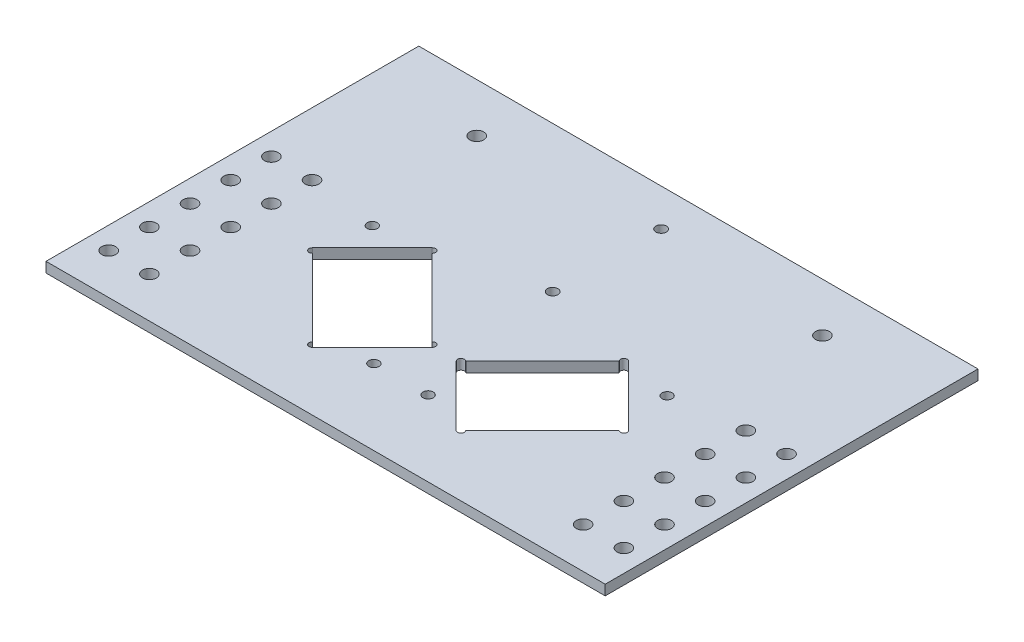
ISO-10303-21;
HEADER;
FILE_DESCRIPTION(('STEP AP214'),'2;1');
FILE_NAME('part.step','',(''),(''),'','','');
FILE_SCHEMA(('AUTOMOTIVE_DESIGN { 1 0 10303 214 1 1 1 1 }'));
ENDSEC;
DATA;
#1=APPLICATION_CONTEXT('core data for automotive mechanical design processes');
#2=APPLICATION_PROTOCOL_DEFINITION('international standard','automotive_design',2000,#1);
#3=PRODUCT_CONTEXT('',#1,'mechanical');
#4=PRODUCT('Part','Part','',(#3));
#5=PRODUCT_RELATED_PRODUCT_CATEGORY('part','',(#4));
#6=PRODUCT_DEFINITION_FORMATION('','',#4);
#7=PRODUCT_DEFINITION_CONTEXT('part definition',#1,'design');
#8=PRODUCT_DEFINITION('design','',#6,#7);
#9=PRODUCT_DEFINITION_SHAPE('','',#8);
#10=(LENGTH_UNIT() NAMED_UNIT(*) SI_UNIT(.MILLI.,.METRE.));
#11=(NAMED_UNIT(*) PLANE_ANGLE_UNIT() SI_UNIT($,.RADIAN.));
#12=(NAMED_UNIT(*) SI_UNIT($,.STERADIAN.) SOLID_ANGLE_UNIT());
#13=UNCERTAINTY_MEASURE_WITH_UNIT(LENGTH_MEASURE(1.E-05),#10,'distance_accuracy_value','');
#14=(GEOMETRIC_REPRESENTATION_CONTEXT(3) GLOBAL_UNCERTAINTY_ASSIGNED_CONTEXT((#13)) GLOBAL_UNIT_ASSIGNED_CONTEXT((#10,
#11,#12)) REPRESENTATION_CONTEXT('',''));
#15=CARTESIAN_POINT('',(0.,0.,0.));
#16=DIRECTION('',(0.,0.,1.));
#17=DIRECTION('',(1.,0.,0.));
#18=AXIS2_PLACEMENT_3D('',#15,#16,#17);
#19=CARTESIAN_POINT('',(146.5,0.,-60.));
#20=DIRECTION('',(0.,1.,0.));
#21=DIRECTION('',(0.,0.,1.));
#22=AXIS2_PLACEMENT_3D('',#19,#20,#21);
#23=CYLINDRICAL_SURFACE('',#22,2.04999999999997);
#24=CARTESIAN_POINT('',(146.5,0.,-60.));
#25=DIRECTION('',(0.,1.,0.));
#26=DIRECTION('',(0.,0.,-1.));
#27=AXIS2_PLACEMENT_3D('',#24,#25,#26);
#28=CIRCLE('',#27,2.04999999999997);
#29=CARTESIAN_POINT('',(146.5,0.,-62.05));
#30=VERTEX_POINT('',#29);
#31=EDGE_CURVE('E485',#30,#30,#28,.T.);
#32=ORIENTED_EDGE('',*,*,#31,.F.);
#33=EDGE_LOOP('',(#32));
#34=FACE_BOUND('',#33,.T.);
#35=CARTESIAN_POINT('',(146.5,3.,-60.));
#36=DIRECTION('',(0.,1.,0.));
#37=DIRECTION('',(0.,0.,-1.));
#38=AXIS2_PLACEMENT_3D('',#35,#36,#37);
#39=CIRCLE('',#38,2.04999999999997);
#40=CARTESIAN_POINT('',(146.5,3.,-62.05));
#41=VERTEX_POINT('',#40);
#42=EDGE_CURVE('E487',#41,#41,#39,.T.);
#43=ORIENTED_EDGE('',*,*,#42,.T.);
#44=EDGE_LOOP('',(#43));
#45=FACE_BOUND('',#44,.T.);
#46=ADVANCED_FACE('F39',(#34,#45),#23,.F.);
#47=CARTESIAN_POINT('',(146.5,0.,-48.));
#48=DIRECTION('',(0.,1.,0.));
#49=DIRECTION('',(0.,0.,1.));
#50=AXIS2_PLACEMENT_3D('',#47,#48,#49);
#51=CYLINDRICAL_SURFACE('',#50,2.04999999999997);
#52=CARTESIAN_POINT('',(146.5,0.,-48.));
#53=DIRECTION('',(0.,1.,0.));
#54=DIRECTION('',(0.,0.,-1.));
#55=AXIS2_PLACEMENT_3D('',#52,#53,#54);
#56=CIRCLE('',#55,2.04999999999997);
#57=CARTESIAN_POINT('',(146.5,0.,-50.05));
#58=VERTEX_POINT('',#57);
#59=EDGE_CURVE('E478',#58,#58,#56,.T.);
#60=ORIENTED_EDGE('',*,*,#59,.F.);
#61=EDGE_LOOP('',(#60));
#62=FACE_BOUND('',#61,.T.);
#63=CARTESIAN_POINT('',(146.5,3.,-48.));
#64=DIRECTION('',(0.,1.,0.));
#65=DIRECTION('',(0.,0.,-1.));
#66=AXIS2_PLACEMENT_3D('',#63,#64,#65);
#67=CIRCLE('',#66,2.04999999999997);
#68=CARTESIAN_POINT('',(146.5,3.,-50.05));
#69=VERTEX_POINT('',#68);
#70=EDGE_CURVE('E480',#69,#69,#67,.T.);
#71=ORIENTED_EDGE('',*,*,#70,.T.);
#72=EDGE_LOOP('',(#71));
#73=FACE_BOUND('',#72,.T.);
#74=ADVANCED_FACE('F731',(#62,#73),#51,.F.);
#75=CARTESIAN_POINT('',(146.5,0.,-36.));
#76=DIRECTION('',(0.,1.,0.));
#77=DIRECTION('',(0.,0.,1.));
#78=AXIS2_PLACEMENT_3D('',#75,#76,#77);
#79=CYLINDRICAL_SURFACE('',#78,2.04999999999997);
#80=CARTESIAN_POINT('',(146.5,0.,-36.));
#81=DIRECTION('',(0.,1.,0.));
#82=DIRECTION('',(0.,0.,-1.));
#83=AXIS2_PLACEMENT_3D('',#80,#81,#82);
#84=CIRCLE('',#83,2.04999999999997);
#85=CARTESIAN_POINT('',(146.5,0.,-38.05));
#86=VERTEX_POINT('',#85);
#87=EDGE_CURVE('E470',#86,#86,#84,.T.);
#88=ORIENTED_EDGE('',*,*,#87,.F.);
#89=EDGE_LOOP('',(#88));
#90=FACE_BOUND('',#89,.T.);
#91=CARTESIAN_POINT('',(146.5,3.,-36.));
#92=DIRECTION('',(0.,1.,0.));
#93=DIRECTION('',(0.,0.,-1.));
#94=AXIS2_PLACEMENT_3D('',#91,#92,#93);
#95=CIRCLE('',#94,2.04999999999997);
#96=CARTESIAN_POINT('',(146.5,3.,-38.05));
#97=VERTEX_POINT('',#96);
#98=EDGE_CURVE('E473',#97,#97,#95,.T.);
#99=ORIENTED_EDGE('',*,*,#98,.T.);
#100=EDGE_LOOP('',(#99));
#101=FACE_BOUND('',#100,.T.);
#102=ADVANCED_FACE('F736',(#90,#101),#79,.F.);
#103=CARTESIAN_POINT('',(158.5,0.,-60.));
#104=DIRECTION('',(0.,1.,0.));
#105=DIRECTION('',(0.,0.,1.));
#106=AXIS2_PLACEMENT_3D('',#103,#104,#105);
#107=CYLINDRICAL_SURFACE('',#106,2.04999999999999);
#108=CARTESIAN_POINT('',(158.5,0.,-60.));
#109=DIRECTION('',(0.,1.,0.));
#110=DIRECTION('',(0.,0.,-1.));
#111=AXIS2_PLACEMENT_3D('',#108,#109,#110);
#112=CIRCLE('',#111,2.04999999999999);
#113=CARTESIAN_POINT('',(158.5,0.,-62.05));
#114=VERTEX_POINT('',#113);
#115=EDGE_CURVE('E463',#114,#114,#112,.T.);
#116=ORIENTED_EDGE('',*,*,#115,.F.);
#117=EDGE_LOOP('',(#116));
#118=FACE_BOUND('',#117,.T.);
#119=CARTESIAN_POINT('',(158.5,3.,-60.));
#120=DIRECTION('',(0.,1.,0.));
#121=DIRECTION('',(0.,0.,-1.));
#122=AXIS2_PLACEMENT_3D('',#119,#120,#121);
#123=CIRCLE('',#122,2.04999999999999);
#124=CARTESIAN_POINT('',(158.5,3.,-62.05));
#125=VERTEX_POINT('',#124);
#126=EDGE_CURVE('E465',#125,#125,#123,.T.);
#127=ORIENTED_EDGE('',*,*,#126,.T.);
#128=EDGE_LOOP('',(#127));
#129=FACE_BOUND('',#128,.T.);
#130=ADVANCED_FACE('F796',(#118,#129),#107,.F.);
#131=CARTESIAN_POINT('',(158.5,0.,-48.));
#132=DIRECTION('',(0.,1.,0.));
#133=DIRECTION('',(0.,0.,1.));
#134=AXIS2_PLACEMENT_3D('',#131,#132,#133);
#135=CYLINDRICAL_SURFACE('',#134,2.04999999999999);
#136=CARTESIAN_POINT('',(158.5,0.,-48.));
#137=DIRECTION('',(0.,1.,0.));
#138=DIRECTION('',(0.,0.,-1.));
#139=AXIS2_PLACEMENT_3D('',#136,#137,#138);
#140=CIRCLE('',#139,2.04999999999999);
#141=CARTESIAN_POINT('',(158.5,0.,-50.05));
#142=VERTEX_POINT('',#141);
#143=EDGE_CURVE('E452',#142,#142,#140,.T.);
#144=ORIENTED_EDGE('',*,*,#143,.F.);
#145=EDGE_LOOP('',(#144));
#146=FACE_BOUND('',#145,.T.);
#147=CARTESIAN_POINT('',(158.5,3.,-48.));
#148=DIRECTION('',(0.,1.,0.));
#149=DIRECTION('',(0.,0.,-1.));
#150=AXIS2_PLACEMENT_3D('',#147,#148,#149);
#151=CIRCLE('',#150,2.04999999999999);
#152=CARTESIAN_POINT('',(158.5,3.,-50.05));
#153=VERTEX_POINT('',#152);
#154=EDGE_CURVE('E458',#153,#153,#151,.T.);
#155=ORIENTED_EDGE('',*,*,#154,.T.);
#156=EDGE_LOOP('',(#155));
#157=FACE_BOUND('',#156,.T.);
#158=ADVANCED_FACE('F792',(#146,#157),#135,.F.);
#159=CARTESIAN_POINT('',(158.5,0.,-36.));
#160=DIRECTION('',(0.,1.,0.));
#161=DIRECTION('',(0.,0.,1.));
#162=AXIS2_PLACEMENT_3D('',#159,#160,#161);
#163=CYLINDRICAL_SURFACE('',#162,2.04999999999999);
#164=CARTESIAN_POINT('',(158.5,0.,-36.));
#165=DIRECTION('',(0.,1.,0.));
#166=DIRECTION('',(0.,0.,-1.));
#167=AXIS2_PLACEMENT_3D('',#164,#165,#166);
#168=CIRCLE('',#167,2.04999999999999);
#169=CARTESIAN_POINT('',(158.5,0.,-38.05));
#170=VERTEX_POINT('',#169);
#171=EDGE_CURVE('E444',#170,#170,#168,.T.);
#172=ORIENTED_EDGE('',*,*,#171,.F.);
#173=EDGE_LOOP('',(#172));
#174=FACE_BOUND('',#173,.T.);
#175=CARTESIAN_POINT('',(158.5,3.,-36.));
#176=DIRECTION('',(0.,1.,0.));
#177=DIRECTION('',(0.,0.,-1.));
#178=AXIS2_PLACEMENT_3D('',#175,#176,#177);
#179=CIRCLE('',#178,2.04999999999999);
#180=CARTESIAN_POINT('',(158.5,3.,-38.05));
#181=VERTEX_POINT('',#180);
#182=EDGE_CURVE('E447',#181,#181,#179,.T.);
#183=ORIENTED_EDGE('',*,*,#182,.T.);
#184=EDGE_LOOP('',(#183));
#185=FACE_BOUND('',#184,.T.);
#186=ADVANCED_FACE('F788',(#174,#185),#163,.F.);
#187=CARTESIAN_POINT('',(6.5,0.,-60.));
#188=DIRECTION('',(0.,1.,0.));
#189=DIRECTION('',(0.,0.,1.));
#190=AXIS2_PLACEMENT_3D('',#187,#188,#189);
#191=CYLINDRICAL_SURFACE('',#190,2.05);
#192=CARTESIAN_POINT('',(6.5,0.,-60.));
#193=DIRECTION('',(0.,1.,0.));
#194=DIRECTION('',(0.,0.,1.));
#195=AXIS2_PLACEMENT_3D('',#192,#193,#194);
#196=CIRCLE('',#195,2.05);
#197=CARTESIAN_POINT('',(6.5,0.,-57.95));
#198=VERTEX_POINT('',#197);
#199=EDGE_CURVE('E437',#198,#198,#196,.T.);
#200=ORIENTED_EDGE('',*,*,#199,.F.);
#201=EDGE_LOOP('',(#200));
#202=FACE_BOUND('',#201,.T.);
#203=CARTESIAN_POINT('',(6.5,3.,-60.));
#204=DIRECTION('',(0.,1.,0.));
#205=DIRECTION('',(0.,0.,1.));
#206=AXIS2_PLACEMENT_3D('',#203,#204,#205);
#207=CIRCLE('',#206,2.05);
#208=CARTESIAN_POINT('',(6.5,3.,-57.95));
#209=VERTEX_POINT('',#208);
#210=EDGE_CURVE('E439',#209,#209,#207,.T.);
#211=ORIENTED_EDGE('',*,*,#210,.T.);
#212=EDGE_LOOP('',(#211));
#213=FACE_BOUND('',#212,.T.);
#214=ADVANCED_FACE('F784',(#202,#213),#191,.F.);
#215=CARTESIAN_POINT('',(6.5,0.,-48.));
#216=DIRECTION('',(0.,1.,0.));
#217=DIRECTION('',(0.,0.,1.));
#218=AXIS2_PLACEMENT_3D('',#215,#216,#217);
#219=CYLINDRICAL_SURFACE('',#218,2.05);
#220=CARTESIAN_POINT('',(6.5,0.,-48.));
#221=DIRECTION('',(0.,1.,0.));
#222=DIRECTION('',(0.,0.,1.));
#223=AXIS2_PLACEMENT_3D('',#220,#221,#222);
#224=CIRCLE('',#223,2.05);
#225=CARTESIAN_POINT('',(6.5,0.,-45.95));
#226=VERTEX_POINT('',#225);
#227=EDGE_CURVE('E426',#226,#226,#224,.T.);
#228=ORIENTED_EDGE('',*,*,#227,.F.);
#229=EDGE_LOOP('',(#228));
#230=FACE_BOUND('',#229,.T.);
#231=CARTESIAN_POINT('',(6.5,3.,-48.));
#232=DIRECTION('',(0.,1.,0.));
#233=DIRECTION('',(0.,0.,1.));
#234=AXIS2_PLACEMENT_3D('',#231,#232,#233);
#235=CIRCLE('',#234,2.05);
#236=CARTESIAN_POINT('',(6.5,3.,-45.95));
#237=VERTEX_POINT('',#236);
#238=EDGE_CURVE('E432',#237,#237,#235,.T.);
#239=ORIENTED_EDGE('',*,*,#238,.T.);
#240=EDGE_LOOP('',(#239));
#241=FACE_BOUND('',#240,.T.);
#242=ADVANCED_FACE('F780',(#230,#241),#219,.F.);
#243=CARTESIAN_POINT('',(6.5,0.,-36.));
#244=DIRECTION('',(0.,1.,0.));
#245=DIRECTION('',(0.,0.,1.));
#246=AXIS2_PLACEMENT_3D('',#243,#244,#245);
#247=CYLINDRICAL_SURFACE('',#246,2.05);
#248=CARTESIAN_POINT('',(6.5,0.,-36.));
#249=DIRECTION('',(0.,1.,0.));
#250=DIRECTION('',(0.,0.,1.));
#251=AXIS2_PLACEMENT_3D('',#248,#249,#250);
#252=CIRCLE('',#251,2.05);
#253=CARTESIAN_POINT('',(6.5,0.,-33.95));
#254=VERTEX_POINT('',#253);
#255=EDGE_CURVE('E418',#254,#254,#252,.T.);
#256=ORIENTED_EDGE('',*,*,#255,.F.);
#257=EDGE_LOOP('',(#256));
#258=FACE_BOUND('',#257,.T.);
#259=CARTESIAN_POINT('',(6.5,3.,-36.));
#260=DIRECTION('',(0.,1.,0.));
#261=DIRECTION('',(0.,0.,1.));
#262=AXIS2_PLACEMENT_3D('',#259,#260,#261);
#263=CIRCLE('',#262,2.05);
#264=CARTESIAN_POINT('',(6.5,3.,-33.95));
#265=VERTEX_POINT('',#264);
#266=EDGE_CURVE('E421',#265,#265,#263,.T.);
#267=ORIENTED_EDGE('',*,*,#266,.T.);
#268=EDGE_LOOP('',(#267));
#269=FACE_BOUND('',#268,.T.);
#270=ADVANCED_FACE('F776',(#258,#269),#247,.F.);
#271=CARTESIAN_POINT('',(18.5,0.,-60.));
#272=DIRECTION('',(0.,1.,0.));
#273=DIRECTION('',(0.,0.,1.));
#274=AXIS2_PLACEMENT_3D('',#271,#272,#273);
#275=CYLINDRICAL_SURFACE('',#274,2.05);
#276=CARTESIAN_POINT('',(18.5,0.,-60.));
#277=DIRECTION('',(0.,1.,0.));
#278=DIRECTION('',(0.,0.,1.));
#279=AXIS2_PLACEMENT_3D('',#276,#277,#278);
#280=CIRCLE('',#279,2.05);
#281=CARTESIAN_POINT('',(18.5,0.,-57.95));
#282=VERTEX_POINT('',#281);
#283=EDGE_CURVE('E411',#282,#282,#280,.T.);
#284=ORIENTED_EDGE('',*,*,#283,.F.);
#285=EDGE_LOOP('',(#284));
#286=FACE_BOUND('',#285,.T.);
#287=CARTESIAN_POINT('',(18.5,3.,-60.));
#288=DIRECTION('',(0.,1.,0.));
#289=DIRECTION('',(0.,0.,1.));
#290=AXIS2_PLACEMENT_3D('',#287,#288,#289);
#291=CIRCLE('',#290,2.05);
#292=CARTESIAN_POINT('',(18.5,3.,-57.95));
#293=VERTEX_POINT('',#292);
#294=EDGE_CURVE('E413',#293,#293,#291,.T.);
#295=ORIENTED_EDGE('',*,*,#294,.T.);
#296=EDGE_LOOP('',(#295));
#297=FACE_BOUND('',#296,.T.);
#298=ADVANCED_FACE('F772',(#286,#297),#275,.F.);
#299=CARTESIAN_POINT('',(18.5,0.,-48.));
#300=DIRECTION('',(0.,1.,0.));
#301=DIRECTION('',(0.,0.,1.));
#302=AXIS2_PLACEMENT_3D('',#299,#300,#301);
#303=CYLINDRICAL_SURFACE('',#302,2.05);
#304=CARTESIAN_POINT('',(18.5,0.,-48.));
#305=DIRECTION('',(0.,1.,0.));
#306=DIRECTION('',(0.,0.,1.));
#307=AXIS2_PLACEMENT_3D('',#304,#305,#306);
#308=CIRCLE('',#307,2.05);
#309=CARTESIAN_POINT('',(18.5,0.,-45.95));
#310=VERTEX_POINT('',#309);
#311=EDGE_CURVE('E400',#310,#310,#308,.T.);
#312=ORIENTED_EDGE('',*,*,#311,.F.);
#313=EDGE_LOOP('',(#312));
#314=FACE_BOUND('',#313,.T.);
#315=CARTESIAN_POINT('',(18.5,3.,-48.));
#316=DIRECTION('',(0.,1.,0.));
#317=DIRECTION('',(0.,0.,1.));
#318=AXIS2_PLACEMENT_3D('',#315,#316,#317);
#319=CIRCLE('',#318,2.05);
#320=CARTESIAN_POINT('',(18.5,3.,-45.95));
#321=VERTEX_POINT('',#320);
#322=EDGE_CURVE('E406',#321,#321,#319,.T.);
#323=ORIENTED_EDGE('',*,*,#322,.T.);
#324=EDGE_LOOP('',(#323));
#325=FACE_BOUND('',#324,.T.);
#326=ADVANCED_FACE('F768',(#314,#325),#303,.F.);
#327=CARTESIAN_POINT('',(18.5,0.,-36.));
#328=DIRECTION('',(0.,1.,0.));
#329=DIRECTION('',(0.,0.,1.));
#330=AXIS2_PLACEMENT_3D('',#327,#328,#329);
#331=CYLINDRICAL_SURFACE('',#330,2.05);
#332=CARTESIAN_POINT('',(18.5,0.,-36.));
#333=DIRECTION('',(0.,1.,0.));
#334=DIRECTION('',(0.,0.,1.));
#335=AXIS2_PLACEMENT_3D('',#332,#333,#334);
#336=CIRCLE('',#335,2.05);
#337=CARTESIAN_POINT('',(18.5,0.,-33.95));
#338=VERTEX_POINT('',#337);
#339=EDGE_CURVE('E392',#338,#338,#336,.T.);
#340=ORIENTED_EDGE('',*,*,#339,.F.);
#341=EDGE_LOOP('',(#340));
#342=FACE_BOUND('',#341,.T.);
#343=CARTESIAN_POINT('',(18.5,3.,-36.));
#344=DIRECTION('',(0.,1.,0.));
#345=DIRECTION('',(0.,0.,1.));
#346=AXIS2_PLACEMENT_3D('',#343,#344,#345);
#347=CIRCLE('',#346,2.05);
#348=CARTESIAN_POINT('',(18.5,3.,-33.95));
#349=VERTEX_POINT('',#348);
#350=EDGE_CURVE('E395',#349,#349,#347,.T.);
#351=ORIENTED_EDGE('',*,*,#350,.T.);
#352=EDGE_LOOP('',(#351));
#353=FACE_BOUND('',#352,.T.);
#354=ADVANCED_FACE('F764',(#342,#353),#331,.F.);
#355=CARTESIAN_POINT('',(0.,3.,0.));
#356=DIRECTION('',(1.,0.,0.));
#357=DIRECTION('',(0.,0.,-1.));
#358=AXIS2_PLACEMENT_3D('',#355,#356,#357);
#359=PLANE('',#358);
#360=DIRECTION('',(0.,0.,1.));
#361=VECTOR('',#360,1.);
#362=CARTESIAN_POINT('',(0.,0.,0.));
#363=LINE('',#362,#361);
#364=CARTESIAN_POINT('',(0.,0.,-110.));
#365=VERTEX_POINT('',#364);
#366=CARTESIAN_POINT('',(0.,0.,0.));
#367=VERTEX_POINT('',#366);
#368=EDGE_CURVE('E347',#365,#367,#363,.T.);
#369=ORIENTED_EDGE('',*,*,#368,.T.);
#370=DIRECTION('',(0.,-1.,0.));
#371=VECTOR('',#370,1.);
#372=CARTESIAN_POINT('',(0.,3.,0.));
#373=LINE('',#372,#371);
#374=CARTESIAN_POINT('',(0.,3.,0.));
#375=VERTEX_POINT('',#374);
#376=EDGE_CURVE('E389',#375,#367,#373,.T.);
#377=ORIENTED_EDGE('',*,*,#376,.F.);
#378=DIRECTION('',(0.,0.,1.));
#379=VECTOR('',#378,1.);
#380=CARTESIAN_POINT('',(0.,3.,0.));
#381=LINE('',#380,#379);
#382=CARTESIAN_POINT('',(0.,3.,-110.));
#383=VERTEX_POINT('',#382);
#384=EDGE_CURVE('E352',#383,#375,#381,.T.);
#385=ORIENTED_EDGE('',*,*,#384,.F.);
#386=DIRECTION('',(0.,-1.,0.));
#387=VECTOR('',#386,1.);
#388=CARTESIAN_POINT('',(0.,3.,-110.));
#389=LINE('',#388,#387);
#390=EDGE_CURVE('E373',#383,#365,#389,.T.);
#391=ORIENTED_EDGE('',*,*,#390,.T.);
#392=EDGE_LOOP('',(#369,#377,#385,#391));
#393=FACE_BOUND('',#392,.T.);
#394=ADVANCED_FACE('F760',(#393),#359,.F.);
#395=CARTESIAN_POINT('',(0.,3.,0.));
#396=DIRECTION('',(0.,0.,-1.));
#397=DIRECTION('',(-1.,0.,0.));
#398=AXIS2_PLACEMENT_3D('',#395,#396,#397);
#399=PLANE('',#398);
#400=DIRECTION('',(1.,0.,0.));
#401=VECTOR('',#400,1.);
#402=CARTESIAN_POINT('',(0.,0.,0.));
#403=LINE('',#402,#401);
#404=CARTESIAN_POINT('',(165.,0.,0.));
#405=VERTEX_POINT('',#404);
#406=EDGE_CURVE('E376',#367,#405,#403,.T.);
#407=ORIENTED_EDGE('',*,*,#406,.T.);
#408=DIRECTION('',(0.,-1.,0.));
#409=VECTOR('',#408,1.);
#410=CARTESIAN_POINT('',(165.,3.,0.));
#411=LINE('',#410,#409);
#412=CARTESIAN_POINT('',(165.,3.,0.));
#413=VERTEX_POINT('',#412);
#414=EDGE_CURVE('E386',#413,#405,#411,.T.);
#415=ORIENTED_EDGE('',*,*,#414,.F.);
#416=DIRECTION('',(1.,0.,0.));
#417=VECTOR('',#416,1.);
#418=CARTESIAN_POINT('',(0.,3.,0.));
#419=LINE('',#418,#417);
#420=EDGE_CURVE('E357',#375,#413,#419,.T.);
#421=ORIENTED_EDGE('',*,*,#420,.F.);
#422=ORIENTED_EDGE('',*,*,#376,.T.);
#423=EDGE_LOOP('',(#407,#415,#421,#422));
#424=FACE_BOUND('',#423,.T.);
#425=ADVANCED_FACE('F756',(#424),#399,.F.);
#426=CARTESIAN_POINT('',(165.,3.,0.));
#427=DIRECTION('',(-1.,0.,0.));
#428=DIRECTION('',(0.,0.,1.));
#429=AXIS2_PLACEMENT_3D('',#426,#427,#428);
#430=PLANE('',#429);
#431=DIRECTION('',(0.,0.,-1.));
#432=VECTOR('',#431,1.);
#433=CARTESIAN_POINT('',(165.,0.,0.));
#434=LINE('',#433,#432);
#435=CARTESIAN_POINT('',(165.,0.,-110.));
#436=VERTEX_POINT('',#435);
#437=EDGE_CURVE('E378',#405,#436,#434,.T.);
#438=ORIENTED_EDGE('',*,*,#437,.T.);
#439=DIRECTION('',(0.,-1.,0.));
#440=VECTOR('',#439,1.);
#441=CARTESIAN_POINT('',(165.,3.,-110.));
#442=LINE('',#441,#440);
#443=CARTESIAN_POINT('',(165.,3.,-110.));
#444=VERTEX_POINT('',#443);
#445=EDGE_CURVE('E383',#444,#436,#442,.T.);
#446=ORIENTED_EDGE('',*,*,#445,.F.);
#447=DIRECTION('',(0.,0.,-1.));
#448=VECTOR('',#447,1.);
#449=CARTESIAN_POINT('',(165.,3.,0.));
#450=LINE('',#449,#448);
#451=EDGE_CURVE('E366',#413,#444,#450,.T.);
#452=ORIENTED_EDGE('',*,*,#451,.F.);
#453=ORIENTED_EDGE('',*,*,#414,.T.);
#454=EDGE_LOOP('',(#438,#446,#452,#453));
#455=FACE_BOUND('',#454,.T.);
#456=ADVANCED_FACE('F752',(#455),#430,.F.);
#457=CARTESIAN_POINT('',(0.,3.,-110.));
#458=DIRECTION('',(0.,0.,1.));
#459=DIRECTION('',(1.,0.,0.));
#460=AXIS2_PLACEMENT_3D('',#457,#458,#459);
#461=PLANE('',#460);
#462=DIRECTION('',(-1.,0.,0.));
#463=VECTOR('',#462,1.);
#464=CARTESIAN_POINT('',(0.,0.,-110.));
#465=LINE('',#464,#463);
#466=EDGE_CURVE('E358',#436,#365,#465,.T.);
#467=ORIENTED_EDGE('',*,*,#466,.T.);
#468=ORIENTED_EDGE('',*,*,#390,.F.);
#469=DIRECTION('',(-1.,0.,0.));
#470=VECTOR('',#469,1.);
#471=CARTESIAN_POINT('',(0.,3.,-110.));
#472=LINE('',#471,#470);
#473=EDGE_CURVE('E369',#444,#383,#472,.T.);
#474=ORIENTED_EDGE('',*,*,#473,.F.);
#475=ORIENTED_EDGE('',*,*,#445,.T.);
#476=EDGE_LOOP('',(#467,#468,#474,#475));
#477=FACE_BOUND('',#476,.T.);
#478=ADVANCED_FACE('F677',(#477),#461,.F.);
#479=CARTESIAN_POINT('',(0.,3.,0.));
#480=DIRECTION('',(0.,-1.,0.));
#481=DIRECTION('',(0.,0.,-1.));
#482=AXIS2_PLACEMENT_3D('',#479,#480,#481);
#483=PLANE('',#482);
#484=CARTESIAN_POINT('',(90.4999999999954,3.,-22.2464286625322));
#485=DIRECTION('',(0.,1.,0.));
#486=DIRECTION('',(0.,0.,1.));
#487=AXIS2_PLACEMENT_3D('',#484,#485,#486);
#488=CIRCLE('',#487,1.49999999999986);
#489=CARTESIAN_POINT('',(90.4999999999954,3.,-20.7464286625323));
#490=VERTEX_POINT('',#489);
#491=EDGE_CURVE('E634',#490,#490,#488,.T.);
#492=ORIENTED_EDGE('',*,*,#491,.F.);
#493=EDGE_LOOP('',(#492));
#494=FACE_BOUND('',#493,.T.);
#495=CARTESIAN_POINT('',(74.4999999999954,3.,-22.2464286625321));
#496=DIRECTION('',(0.,1.,0.));
#497=DIRECTION('',(0.,0.,1.));
#498=AXIS2_PLACEMENT_3D('',#495,#496,#497);
#499=CIRCLE('',#498,1.49999999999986);
#500=CARTESIAN_POINT('',(74.4999999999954,3.,-20.7464286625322));
#501=VERTEX_POINT('',#500);
#502=EDGE_CURVE('E621',#501,#501,#499,.T.);
#503=ORIENTED_EDGE('',*,*,#502,.F.);
#504=EDGE_LOOP('',(#503));
#505=FACE_BOUND('',#504,.T.);
#506=CARTESIAN_POINT('',(39.0129329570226,3.,-57.2690296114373));
#507=DIRECTION('',(0.,1.,0.));
#508=DIRECTION('',(0.,0.,1.));
#509=AXIS2_PLACEMENT_3D('',#506,#507,#508);
#510=CIRCLE('',#509,1.5);
#511=CARTESIAN_POINT('',(39.0129329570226,3.,-55.7690296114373));
#512=VERTEX_POINT('',#511);
#513=EDGE_CURVE('E211',#512,#512,#510,.T.);
#514=ORIENTED_EDGE('',*,*,#513,.F.);
#515=EDGE_LOOP('',(#514));
#516=FACE_BOUND('',#515,.T.);
#517=DIRECTION('',(0.70710678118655,0.,0.707106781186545));
#518=VECTOR('',#517,1.);
#519=CARTESIAN_POINT('',(103.713203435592,3.,-17.3174964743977));
#520=LINE('',#519,#518);
#521=CARTESIAN_POINT('',(86.0355339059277,3.,-34.9951660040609));
#522=VERTEX_POINT('',#521);
#523=CARTESIAN_POINT('',(103.713203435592,3.,-17.3174964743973));
#524=VERTEX_POINT('',#523);
#525=EDGE_CURVE('E208',#522,#524,#520,.T.);
#526=ORIENTED_EDGE('',*,*,#525,.F.);
#527=CARTESIAN_POINT('',(86.7426406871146,3.,-35.7022727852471));
#528=DIRECTION('',(0.,1.,0.));
#529=DIRECTION('',(0.,0.,1.));
#530=AXIS2_PLACEMENT_3D('',#527,#528,#529);
#531=CIRCLE('',#530,0.999999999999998);
#532=CARTESIAN_POINT('',(87.4497474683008,3.,-36.409379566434));
#533=VERTEX_POINT('',#532);
#534=EDGE_CURVE('E542',#533,#522,#531,.T.);
#535=ORIENTED_EDGE('',*,*,#534,.F.);
#536=DIRECTION('',(-0.707106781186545,0.,0.70710678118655));
#537=VECTOR('',#536,1.);
#538=CARTESIAN_POINT('',(111.491378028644,3.,-60.4510101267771));
#539=LINE('',#538,#537);
#540=CARTESIAN_POINT('',(110.07716446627,3.,-59.0367965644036));
#541=VERTEX_POINT('',#540);
#542=EDGE_CURVE('E197',#541,#533,#539,.T.);
#543=ORIENTED_EDGE('',*,*,#542,.F.);
#544=CARTESIAN_POINT('',(110.784271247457,3.,-59.7439033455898));
#545=DIRECTION('',(0.,1.,0.));
#546=DIRECTION('',(0.,0.,1.));
#547=AXIS2_PLACEMENT_3D('',#544,#545,#546);
#548=CIRCLE('',#547,0.999999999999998);
#549=CARTESIAN_POINT('',(111.491378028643,3.,-60.4510101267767));
#550=VERTEX_POINT('',#549);
#551=EDGE_CURVE('E176',#550,#541,#548,.T.);
#552=ORIENTED_EDGE('',*,*,#551,.F.);
#553=DIRECTION('',(-0.707106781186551,0.,-0.707106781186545));
#554=VECTOR('',#553,1.);
#555=CARTESIAN_POINT('',(129.169047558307,3.,-42.7733405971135));
#556=LINE('',#555,#554);
#557=CARTESIAN_POINT('',(129.169047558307,3.,-42.7733405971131));
#558=VERTEX_POINT('',#557);
#559=EDGE_CURVE('E194',#558,#550,#556,.T.);
#560=ORIENTED_EDGE('',*,*,#559,.F.);
#561=CARTESIAN_POINT('',(128.461940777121,3.,-42.066233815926));
#562=DIRECTION('',(0.,1.,0.));
#563=DIRECTION('',(0.,0.,1.));
#564=AXIS2_PLACEMENT_3D('',#561,#562,#563);
#565=CIRCLE('',#564,0.999999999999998);
#566=CARTESIAN_POINT('',(127.754833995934,3.,-41.35912703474));
#567=VERTEX_POINT('',#566);
#568=EDGE_CURVE('E226',#567,#558,#565,.T.);
#569=ORIENTED_EDGE('',*,*,#568,.F.);
#570=DIRECTION('',(0.707106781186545,0.,-0.70710678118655));
#571=VECTOR('',#570,1.);
#572=CARTESIAN_POINT('',(129.169047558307,3.,-42.7733405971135));
#573=LINE('',#572,#571);
#574=CARTESIAN_POINT('',(105.127416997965,3.,-18.7317100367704));
#575=VERTEX_POINT('',#574);
#576=EDGE_CURVE('E502',#575,#567,#573,.T.);
#577=ORIENTED_EDGE('',*,*,#576,.F.);
#578=CARTESIAN_POINT('',(104.420310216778,3.,-18.0246032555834));
#579=DIRECTION('',(0.,1.,0.));
#580=DIRECTION('',(0.,0.,1.));
#581=AXIS2_PLACEMENT_3D('',#578,#579,#580);
#582=CIRCLE('',#581,0.999999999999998);
#583=EDGE_CURVE('E549',#524,#575,#582,.T.);
#584=ORIENTED_EDGE('',*,*,#583,.F.);
#585=EDGE_LOOP('',(#526,#535,#543,#552,#560,#569,#577,#584));
#586=FACE_BOUND('',#585,.T.);
#587=DIRECTION('',(-0.70710678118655,0.,-0.707106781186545));
#588=VECTOR('',#587,1.);
#589=CARTESIAN_POINT('',(53.5086219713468,3.,-60.4510101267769));
#590=LINE('',#589,#588);
#591=CARTESIAN_POINT('',(77.55025253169,3.,-36.409379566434));
#592=VERTEX_POINT('',#591);
#593=CARTESIAN_POINT('',(54.9228355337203,3.,-59.0367965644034));
#594=VERTEX_POINT('',#593);
#595=EDGE_CURVE('E524',#592,#594,#590,.T.);
#596=ORIENTED_EDGE('',*,*,#595,.F.);
#597=CARTESIAN_POINT('',(78.2573593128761,3.,-35.702272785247));
#598=DIRECTION('',(0.,1.,0.));
#599=DIRECTION('',(0.,0.,1.));
#600=AXIS2_PLACEMENT_3D('',#597,#598,#599);
#601=CIRCLE('',#600,0.999999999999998);
#602=CARTESIAN_POINT('',(78.9644660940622,3.,-34.9951660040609));
#603=VERTEX_POINT('',#602);
#604=EDGE_CURVE('E587',#603,#592,#601,.T.);
#605=ORIENTED_EDGE('',*,*,#604,.F.);
#606=DIRECTION('',(0.707106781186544,0.,-0.70710678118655));
#607=VECTOR('',#606,1.);
#608=CARTESIAN_POINT('',(78.9644660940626,3.,-34.9951660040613));
#609=LINE('',#608,#607);
#610=CARTESIAN_POINT('',(61.2867965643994,3.,-17.3174964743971));
#611=VERTEX_POINT('',#610);
#612=EDGE_CURVE('E571',#611,#603,#609,.T.);
#613=ORIENTED_EDGE('',*,*,#612,.F.);
#614=CARTESIAN_POINT('',(60.5796897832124,3.,-18.0246032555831));
#615=DIRECTION('',(0.,1.,0.));
#616=DIRECTION('',(0.,0.,1.));
#617=AXIS2_PLACEMENT_3D('',#614,#615,#616);
#618=CIRCLE('',#617,0.999999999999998);
#619=CARTESIAN_POINT('',(59.8725830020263,3.,-18.7317100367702));
#620=VERTEX_POINT('',#619);
#621=EDGE_CURVE('E583',#620,#611,#618,.T.);
#622=ORIENTED_EDGE('',*,*,#621,.F.);
#623=DIRECTION('',(0.70710678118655,0.,0.707106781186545));
#624=VECTOR('',#623,1.);
#625=CARTESIAN_POINT('',(35.8309524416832,3.,-42.7733405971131));
#626=LINE('',#625,#624);
#627=CARTESIAN_POINT('',(37.2451660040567,3.,-41.3591270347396));
#628=VERTEX_POINT('',#627);
#629=EDGE_CURVE('E566',#628,#620,#626,.T.);
#630=ORIENTED_EDGE('',*,*,#629,.F.);
#631=CARTESIAN_POINT('',(36.5380592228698,3.,-42.0662338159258));
#632=DIRECTION('',(0.,1.,0.));
#633=DIRECTION('',(0.,0.,1.));
#634=AXIS2_PLACEMENT_3D('',#631,#632,#633);
#635=CIRCLE('',#634,0.999999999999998);
#636=CARTESIAN_POINT('',(35.8309524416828,3.,-42.7733405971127));
#637=VERTEX_POINT('',#636);
#638=EDGE_CURVE('E577',#637,#628,#635,.T.);
#639=ORIENTED_EDGE('',*,*,#638,.F.);
#640=DIRECTION('',(-0.707106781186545,0.,0.70710678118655));
#641=VECTOR('',#640,1.);
#642=CARTESIAN_POINT('',(53.5086219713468,3.,-60.4510101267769));
#643=LINE('',#642,#641);
#644=CARTESIAN_POINT('',(53.5086219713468,3.,-60.4510101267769));
#645=VERTEX_POINT('',#644);
#646=EDGE_CURVE('E559',#645,#637,#643,.T.);
#647=ORIENTED_EDGE('',*,*,#646,.F.);
#648=CARTESIAN_POINT('',(54.2157287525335,3.,-59.7439033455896));
#649=DIRECTION('',(0.,1.,0.));
#650=DIRECTION('',(0.,0.,1.));
#651=AXIS2_PLACEMENT_3D('',#648,#649,#650);
#652=CIRCLE('',#651,0.999999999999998);
#653=EDGE_CURVE('E243',#594,#645,#652,.T.);
#654=ORIENTED_EDGE('',*,*,#653,.F.);
#655=EDGE_LOOP('',(#596,#605,#613,#622,#630,#639,#647,#654));
#656=FACE_BOUND('',#655,.T.);
#657=CARTESIAN_POINT('',(125.987067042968,3.,-57.2690296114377));
#658=DIRECTION('',(0.,1.,0.));
#659=DIRECTION('',(0.,0.,1.));
#660=AXIS2_PLACEMENT_3D('',#657,#658,#659);
#661=CIRCLE('',#660,1.49999999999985);
#662=CARTESIAN_POINT('',(125.987067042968,3.,-55.7690296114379));
#663=VERTEX_POINT('',#662);
#664=EDGE_CURVE('E261',#663,#663,#661,.T.);
#665=ORIENTED_EDGE('',*,*,#664,.F.);
#666=EDGE_LOOP('',(#665));
#667=FACE_BOUND('',#666,.T.);
#668=CARTESIAN_POINT('',(82.4999999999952,3.,-67.));
#669=DIRECTION('',(0.,1.,0.));
#670=DIRECTION('',(0.,0.,1.));
#671=AXIS2_PLACEMENT_3D('',#668,#669,#670);
#672=CIRCLE('',#671,1.55000000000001);
#673=CARTESIAN_POINT('',(82.4999999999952,3.,-65.45));
#674=VERTEX_POINT('',#673);
#675=EDGE_CURVE('E658',#674,#674,#672,.T.);
#676=ORIENTED_EDGE('',*,*,#675,.F.);
#677=EDGE_LOOP('',(#676));
#678=FACE_BOUND('',#677,.T.);
#679=CARTESIAN_POINT('',(31.4999999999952,3.,-95.5936785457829));
#680=DIRECTION('',(0.,1.,0.));
#681=DIRECTION('',(0.,0.,1.));
#682=AXIS2_PLACEMENT_3D('',#679,#680,#681);
#683=CIRCLE('',#682,2.05);
#684=CARTESIAN_POINT('',(31.4999999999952,3.,-93.5436785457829));
#685=VERTEX_POINT('',#684);
#686=EDGE_CURVE('E651',#685,#685,#683,.T.);
#687=ORIENTED_EDGE('',*,*,#686,.F.);
#688=EDGE_LOOP('',(#687));
#689=FACE_BOUND('',#688,.T.);
#690=CARTESIAN_POINT('',(82.4999999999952,3.,-99.));
#691=DIRECTION('',(0.,1.,0.));
#692=DIRECTION('',(0.,0.,1.));
#693=AXIS2_PLACEMENT_3D('',#690,#691,#692);
#694=CIRCLE('',#693,1.55000000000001);
#695=CARTESIAN_POINT('',(82.4999999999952,3.,-97.45));
#696=VERTEX_POINT('',#695);
#697=EDGE_CURVE('E643',#696,#696,#694,.T.);
#698=ORIENTED_EDGE('',*,*,#697,.F.);
#699=EDGE_LOOP('',(#698));
#700=FACE_BOUND('',#699,.T.);
#701=CARTESIAN_POINT('',(133.499999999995,3.,-95.5936785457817));
#702=DIRECTION('',(0.,1.,0.));
#703=DIRECTION('',(0.,0.,1.));
#704=AXIS2_PLACEMENT_3D('',#701,#702,#703);
#705=CIRCLE('',#704,2.04999999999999);
#706=CARTESIAN_POINT('',(133.499999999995,3.,-93.5436785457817));
#707=VERTEX_POINT('',#706);
#708=EDGE_CURVE('E273',#707,#707,#705,.T.);
#709=ORIENTED_EDGE('',*,*,#708,.F.);
#710=EDGE_LOOP('',(#709));
#711=FACE_BOUND('',#710,.T.);
#712=CARTESIAN_POINT('',(146.5,3.,-24.));
#713=DIRECTION('',(0.,1.,0.));
#714=DIRECTION('',(0.,0.,-1.));
#715=AXIS2_PLACEMENT_3D('',#712,#713,#714);
#716=CIRCLE('',#715,2.04999999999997);
#717=CARTESIAN_POINT('',(146.5,3.,-26.05));
#718=VERTEX_POINT('',#717);
#719=EDGE_CURVE('E287',#718,#718,#716,.T.);
#720=ORIENTED_EDGE('',*,*,#719,.F.);
#721=EDGE_LOOP('',(#720));
#722=FACE_BOUND('',#721,.T.);
#723=CARTESIAN_POINT('',(158.5,3.,-24.));
#724=DIRECTION('',(0.,1.,0.));
#725=DIRECTION('',(0.,0.,-1.));
#726=AXIS2_PLACEMENT_3D('',#723,#724,#725);
#727=CIRCLE('',#726,2.04999999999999);
#728=CARTESIAN_POINT('',(158.5,3.,-26.05));
#729=VERTEX_POINT('',#728);
#730=EDGE_CURVE('E294',#729,#729,#727,.T.);
#731=ORIENTED_EDGE('',*,*,#730,.F.);
#732=EDGE_LOOP('',(#731));
#733=FACE_BOUND('',#732,.T.);
#734=CARTESIAN_POINT('',(6.5,3.,-24.));
#735=DIRECTION('',(0.,1.,0.));
#736=DIRECTION('',(0.,0.,1.));
#737=AXIS2_PLACEMENT_3D('',#734,#735,#736);
#738=CIRCLE('',#737,2.05);
#739=CARTESIAN_POINT('',(6.5,3.,-21.95));
#740=VERTEX_POINT('',#739);
#741=EDGE_CURVE('E302',#740,#740,#738,.T.);
#742=ORIENTED_EDGE('',*,*,#741,.F.);
#743=EDGE_LOOP('',(#742));
#744=FACE_BOUND('',#743,.T.);
#745=CARTESIAN_POINT('',(18.5,3.,-24.));
#746=DIRECTION('',(0.,1.,0.));
#747=DIRECTION('',(0.,0.,1.));
#748=AXIS2_PLACEMENT_3D('',#745,#746,#747);
#749=CIRCLE('',#748,2.05);
#750=CARTESIAN_POINT('',(18.5,3.,-21.95));
#751=VERTEX_POINT('',#750);
#752=EDGE_CURVE('E313',#751,#751,#749,.T.);
#753=ORIENTED_EDGE('',*,*,#752,.F.);
#754=EDGE_LOOP('',(#753));
#755=FACE_BOUND('',#754,.T.);
#756=CARTESIAN_POINT('',(18.5,3.,-12.));
#757=DIRECTION('',(0.,1.,0.));
#758=DIRECTION('',(0.,0.,1.));
#759=AXIS2_PLACEMENT_3D('',#756,#757,#758);
#760=CIRCLE('',#759,2.05);
#761=CARTESIAN_POINT('',(18.5,3.,-9.95));
#762=VERTEX_POINT('',#761);
#763=EDGE_CURVE('E322',#762,#762,#760,.T.);
#764=ORIENTED_EDGE('',*,*,#763,.F.);
#765=EDGE_LOOP('',(#764));
#766=FACE_BOUND('',#765,.T.);
#767=CARTESIAN_POINT('',(146.5,3.,-12.));
#768=DIRECTION('',(0.,1.,0.));
#769=DIRECTION('',(0.,0.,-1.));
#770=AXIS2_PLACEMENT_3D('',#767,#768,#769);
#771=CIRCLE('',#770,2.04999999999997);
#772=CARTESIAN_POINT('',(146.5,3.,-14.05));
#773=VERTEX_POINT('',#772);
#774=EDGE_CURVE('E330',#773,#773,#771,.T.);
#775=ORIENTED_EDGE('',*,*,#774,.F.);
#776=EDGE_LOOP('',(#775));
#777=FACE_BOUND('',#776,.T.);
#778=CARTESIAN_POINT('',(158.5,3.,-12.));
#779=DIRECTION('',(0.,1.,0.));
#780=DIRECTION('',(0.,0.,-1.));
#781=AXIS2_PLACEMENT_3D('',#778,#779,#780);
#782=CIRCLE('',#781,2.04999999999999);
#783=CARTESIAN_POINT('',(158.5,3.,-14.05));
#784=VERTEX_POINT('',#783);
#785=EDGE_CURVE('E318',#784,#784,#782,.T.);
#786=ORIENTED_EDGE('',*,*,#785,.F.);
#787=EDGE_LOOP('',(#786));
#788=FACE_BOUND('',#787,.T.);
#789=CARTESIAN_POINT('',(6.5,3.,-12.));
#790=DIRECTION('',(0.,1.,0.));
#791=DIRECTION('',(0.,0.,1.));
#792=AXIS2_PLACEMENT_3D('',#789,#790,#791);
#793=CIRCLE('',#792,2.05);
#794=CARTESIAN_POINT('',(6.5,3.,-9.95));
#795=VERTEX_POINT('',#794);
#796=EDGE_CURVE('E321',#795,#795,#793,.T.);
#797=ORIENTED_EDGE('',*,*,#796,.F.);
#798=EDGE_LOOP('',(#797));
#799=FACE_BOUND('',#798,.T.);
#800=ORIENTED_EDGE('',*,*,#384,.T.);
#801=ORIENTED_EDGE('',*,*,#420,.T.);
#802=ORIENTED_EDGE('',*,*,#451,.T.);
#803=ORIENTED_EDGE('',*,*,#473,.T.);
#804=EDGE_LOOP('',(#800,#801,#802,#803));
#805=FACE_BOUND('',#804,.T.);
#806=ORIENTED_EDGE('',*,*,#350,.F.);
#807=EDGE_LOOP('',(#806));
#808=FACE_BOUND('',#807,.T.);
#809=ORIENTED_EDGE('',*,*,#322,.F.);
#810=EDGE_LOOP('',(#809));
#811=FACE_BOUND('',#810,.T.);
#812=ORIENTED_EDGE('',*,*,#294,.F.);
#813=EDGE_LOOP('',(#812));
#814=FACE_BOUND('',#813,.T.);
#815=ORIENTED_EDGE('',*,*,#266,.F.);
#816=EDGE_LOOP('',(#815));
#817=FACE_BOUND('',#816,.T.);
#818=ORIENTED_EDGE('',*,*,#238,.F.);
#819=EDGE_LOOP('',(#818));
#820=FACE_BOUND('',#819,.T.);
#821=ORIENTED_EDGE('',*,*,#210,.F.);
#822=EDGE_LOOP('',(#821));
#823=FACE_BOUND('',#822,.T.);
#824=ORIENTED_EDGE('',*,*,#182,.F.);
#825=EDGE_LOOP('',(#824));
#826=FACE_BOUND('',#825,.T.);
#827=ORIENTED_EDGE('',*,*,#154,.F.);
#828=EDGE_LOOP('',(#827));
#829=FACE_BOUND('',#828,.T.);
#830=ORIENTED_EDGE('',*,*,#126,.F.);
#831=EDGE_LOOP('',(#830));
#832=FACE_BOUND('',#831,.T.);
#833=ORIENTED_EDGE('',*,*,#98,.F.);
#834=EDGE_LOOP('',(#833));
#835=FACE_BOUND('',#834,.T.);
#836=ORIENTED_EDGE('',*,*,#70,.F.);
#837=EDGE_LOOP('',(#836));
#838=FACE_BOUND('',#837,.T.);
#839=ORIENTED_EDGE('',*,*,#42,.F.);
#840=EDGE_LOOP('',(#839));
#841=FACE_BOUND('',#840,.T.);
#842=ADVANCED_FACE('F191',(#494,#505,#516,#586,#656,#667,#678,#689,#700,#711,#722,#733,#744,
#755,#766,#777,#788,#799,#805,#808,#811,#814,#817,#820,#823,#826,#829,#832,#835,#838,#841),#483,.F.);
#843=CARTESIAN_POINT('',(0.,0.,0.));
#844=DIRECTION('',(0.,-1.,0.));
#845=DIRECTION('',(0.,0.,-1.));
#846=AXIS2_PLACEMENT_3D('',#843,#844,#845);
#847=PLANE('',#846);
#848=CARTESIAN_POINT('',(78.2573593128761,0.,-35.702272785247));
#849=DIRECTION('',(0.,1.,0.));
#850=DIRECTION('',(0.,0.,1.));
#851=AXIS2_PLACEMENT_3D('',#848,#849,#850);
#852=CIRCLE('',#851,0.999999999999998);
#853=CARTESIAN_POINT('',(78.9644660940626,0.,-34.9951660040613));
#854=VERTEX_POINT('',#853);
#855=CARTESIAN_POINT('',(77.55025253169,0.,-36.409379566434));
#856=VERTEX_POINT('',#855);
#857=EDGE_CURVE('E237',#854,#856,#852,.T.);
#858=ORIENTED_EDGE('',*,*,#857,.T.);
#859=DIRECTION('',(-0.70710678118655,0.,-0.707106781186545));
#860=VECTOR('',#859,1.);
#861=CARTESIAN_POINT('',(53.5086219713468,0.,-60.4510101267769));
#862=LINE('',#861,#860);
#863=CARTESIAN_POINT('',(54.9228355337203,0.,-59.0367965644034));
#864=VERTEX_POINT('',#863);
#865=EDGE_CURVE('E533',#856,#864,#862,.T.);
#866=ORIENTED_EDGE('',*,*,#865,.T.);
#867=CARTESIAN_POINT('',(54.2157287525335,0.,-59.7439033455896));
#868=DIRECTION('',(0.,1.,0.));
#869=DIRECTION('',(0.,0.,1.));
#870=AXIS2_PLACEMENT_3D('',#867,#868,#869);
#871=CIRCLE('',#870,0.999999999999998);
#872=CARTESIAN_POINT('',(53.5086219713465,0.,-60.4510101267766));
#873=VERTEX_POINT('',#872);
#874=EDGE_CURVE('E244',#864,#873,#871,.T.);
#875=ORIENTED_EDGE('',*,*,#874,.T.);
#876=DIRECTION('',(-0.707106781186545,0.,0.70710678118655));
#877=VECTOR('',#876,1.);
#878=CARTESIAN_POINT('',(53.5086219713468,0.,-60.4510101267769));
#879=LINE('',#878,#877);
#880=CARTESIAN_POINT('',(35.8309524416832,0.,-42.7733405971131));
#881=VERTEX_POINT('',#880);
#882=EDGE_CURVE('E604',#873,#881,#879,.T.);
#883=ORIENTED_EDGE('',*,*,#882,.T.);
#884=CARTESIAN_POINT('',(36.5380592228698,0.,-42.0662338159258));
#885=DIRECTION('',(0.,1.,0.));
#886=DIRECTION('',(0.,0.,1.));
#887=AXIS2_PLACEMENT_3D('',#884,#885,#886);
#888=CIRCLE('',#887,0.999999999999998);
#889=CARTESIAN_POINT('',(37.2451660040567,0.,-41.3591270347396));
#890=VERTEX_POINT('',#889);
#891=EDGE_CURVE('E581',#881,#890,#888,.T.);
#892=ORIENTED_EDGE('',*,*,#891,.T.);
#893=DIRECTION('',(0.70710678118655,0.,0.707106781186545));
#894=VECTOR('',#893,1.);
#895=CARTESIAN_POINT('',(35.8309524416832,0.,-42.7733405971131));
#896=LINE('',#895,#894);
#897=CARTESIAN_POINT('',(59.8725830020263,0.,-18.7317100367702));
#898=VERTEX_POINT('',#897);
#899=EDGE_CURVE('E606',#890,#898,#896,.T.);
#900=ORIENTED_EDGE('',*,*,#899,.T.);
#901=CARTESIAN_POINT('',(60.5796897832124,0.,-18.0246032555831));
#902=DIRECTION('',(0.,1.,0.));
#903=DIRECTION('',(0.,0.,1.));
#904=AXIS2_PLACEMENT_3D('',#901,#902,#903);
#905=CIRCLE('',#904,0.999999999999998);
#906=CARTESIAN_POINT('',(61.2867965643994,0.,-17.3174964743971));
#907=VERTEX_POINT('',#906);
#908=EDGE_CURVE('E53',#898,#907,#905,.T.);
#909=ORIENTED_EDGE('',*,*,#908,.T.);
#910=DIRECTION('',(0.707106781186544,0.,-0.70710678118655));
#911=VECTOR('',#910,1.);
#912=CARTESIAN_POINT('',(78.9644660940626,0.,-34.9951660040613));
#913=LINE('',#912,#911);
#914=EDGE_CURVE('E560',#907,#854,#913,.T.);
#915=ORIENTED_EDGE('',*,*,#914,.T.);
#916=EDGE_LOOP('',(#858,#866,#875,#883,#892,#900,#909,#915));
#917=FACE_BOUND('',#916,.T.);
#918=CARTESIAN_POINT('',(86.7426406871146,0.,-35.7022727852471));
#919=DIRECTION('',(0.,1.,0.));
#920=DIRECTION('',(0.,0.,1.));
#921=AXIS2_PLACEMENT_3D('',#918,#919,#920);
#922=CIRCLE('',#921,0.999999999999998);
#923=CARTESIAN_POINT('',(87.4497474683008,0.,-36.409379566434));
#924=VERTEX_POINT('',#923);
#925=CARTESIAN_POINT('',(86.0355339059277,0.,-34.9951660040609));
#926=VERTEX_POINT('',#925);
#927=EDGE_CURVE('E547',#924,#926,#922,.T.);
#928=ORIENTED_EDGE('',*,*,#927,.T.);
#929=DIRECTION('',(0.70710678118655,0.,0.707106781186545));
#930=VECTOR('',#929,1.);
#931=CARTESIAN_POINT('',(103.713203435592,0.,-17.3174964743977));
#932=LINE('',#931,#930);
#933=CARTESIAN_POINT('',(103.713203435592,0.,-17.3174964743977));
#934=VERTEX_POINT('',#933);
#935=EDGE_CURVE('E510',#926,#934,#932,.T.);
#936=ORIENTED_EDGE('',*,*,#935,.T.);
#937=CARTESIAN_POINT('',(104.420310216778,0.,-18.0246032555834));
#938=DIRECTION('',(0.,1.,0.));
#939=DIRECTION('',(0.,0.,1.));
#940=AXIS2_PLACEMENT_3D('',#937,#938,#939);
#941=CIRCLE('',#940,0.999999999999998);
#942=CARTESIAN_POINT('',(105.127416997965,0.,-18.7317100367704));
#943=VERTEX_POINT('',#942);
#944=EDGE_CURVE('E509',#934,#943,#941,.T.);
#945=ORIENTED_EDGE('',*,*,#944,.T.);
#946=DIRECTION('',(0.707106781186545,0.,-0.70710678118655));
#947=VECTOR('',#946,1.);
#948=CARTESIAN_POINT('',(129.169047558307,0.,-42.7733405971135));
#949=LINE('',#948,#947);
#950=CARTESIAN_POINT('',(127.754833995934,0.,-41.35912703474));
#951=VERTEX_POINT('',#950);
#952=EDGE_CURVE('E185',#943,#951,#949,.T.);
#953=ORIENTED_EDGE('',*,*,#952,.T.);
#954=CARTESIAN_POINT('',(128.461940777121,0.,-42.066233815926));
#955=DIRECTION('',(0.,1.,0.));
#956=DIRECTION('',(0.,0.,1.));
#957=AXIS2_PLACEMENT_3D('',#954,#955,#956);
#958=CIRCLE('',#957,0.999999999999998);
#959=CARTESIAN_POINT('',(129.169047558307,0.,-42.7733405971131));
#960=VERTEX_POINT('',#959);
#961=EDGE_CURVE('E60',#951,#960,#958,.T.);
#962=ORIENTED_EDGE('',*,*,#961,.T.);
#963=DIRECTION('',(-0.707106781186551,0.,-0.707106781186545));
#964=VECTOR('',#963,1.);
#965=CARTESIAN_POINT('',(129.169047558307,0.,-42.7733405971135));
#966=LINE('',#965,#964);
#967=CARTESIAN_POINT('',(111.491378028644,0.,-60.4510101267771));
#968=VERTEX_POINT('',#967);
#969=EDGE_CURVE('E514',#960,#968,#966,.T.);
#970=ORIENTED_EDGE('',*,*,#969,.T.);
#971=CARTESIAN_POINT('',(110.784271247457,0.,-59.7439033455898));
#972=DIRECTION('',(0.,1.,0.));
#973=DIRECTION('',(0.,0.,1.));
#974=AXIS2_PLACEMENT_3D('',#971,#972,#973);
#975=CIRCLE('',#974,0.999999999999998);
#976=CARTESIAN_POINT('',(110.07716446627,0.,-59.0367965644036));
#977=VERTEX_POINT('',#976);
#978=EDGE_CURVE('E179',#968,#977,#975,.T.);
#979=ORIENTED_EDGE('',*,*,#978,.T.);
#980=DIRECTION('',(-0.707106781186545,0.,0.70710678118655));
#981=VECTOR('',#980,1.);
#982=CARTESIAN_POINT('',(111.491378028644,0.,-60.4510101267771));
#983=LINE('',#982,#981);
#984=EDGE_CURVE('E511',#977,#924,#983,.T.);
#985=ORIENTED_EDGE('',*,*,#984,.T.);
#986=EDGE_LOOP('',(#928,#936,#945,#953,#962,#970,#979,#985));
#987=FACE_BOUND('',#986,.T.);
#988=CARTESIAN_POINT('',(90.4999999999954,0.,-22.2464286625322));
#989=DIRECTION('',(0.,1.,0.));
#990=DIRECTION('',(0.,0.,1.));
#991=AXIS2_PLACEMENT_3D('',#988,#989,#990);
#992=CIRCLE('',#991,1.49999999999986);
#993=CARTESIAN_POINT('',(90.4999999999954,0.,-20.7464286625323));
#994=VERTEX_POINT('',#993);
#995=EDGE_CURVE('E268',#994,#994,#992,.T.);
#996=ORIENTED_EDGE('',*,*,#995,.T.);
#997=EDGE_LOOP('',(#996));
#998=FACE_BOUND('',#997,.T.);
#999=CARTESIAN_POINT('',(74.4999999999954,0.,-22.2464286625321));
#1000=DIRECTION('',(0.,1.,0.));
#1001=DIRECTION('',(0.,0.,1.));
#1002=AXIS2_PLACEMENT_3D('',#999,#1000,#1001);
#1003=CIRCLE('',#1002,1.49999999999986);
#1004=CARTESIAN_POINT('',(74.4999999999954,0.,-20.7464286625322));
#1005=VERTEX_POINT('',#1004);
#1006=EDGE_CURVE('E624',#1005,#1005,#1003,.T.);
#1007=ORIENTED_EDGE('',*,*,#1006,.T.);
#1008=EDGE_LOOP('',(#1007));
#1009=FACE_BOUND('',#1008,.T.);
#1010=CARTESIAN_POINT('',(39.0129329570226,0.,-57.2690296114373));
#1011=DIRECTION('',(0.,1.,0.));
#1012=DIRECTION('',(0.,0.,1.));
#1013=AXIS2_PLACEMENT_3D('',#1010,#1011,#1012);
#1014=CIRCLE('',#1013,1.5);
#1015=CARTESIAN_POINT('',(39.0129329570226,0.,-55.7690296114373));
#1016=VERTEX_POINT('',#1015);
#1017=EDGE_CURVE('E204',#1016,#1016,#1014,.T.);
#1018=ORIENTED_EDGE('',*,*,#1017,.T.);
#1019=EDGE_LOOP('',(#1018));
#1020=FACE_BOUND('',#1019,.T.);
#1021=CARTESIAN_POINT('',(125.987067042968,0.,-57.2690296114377));
#1022=DIRECTION('',(0.,1.,0.));
#1023=DIRECTION('',(0.,0.,1.));
#1024=AXIS2_PLACEMENT_3D('',#1021,#1022,#1023);
#1025=CIRCLE('',#1024,1.49999999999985);
#1026=CARTESIAN_POINT('',(125.987067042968,0.,-55.7690296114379));
#1027=VERTEX_POINT('',#1026);
#1028=EDGE_CURVE('E267',#1027,#1027,#1025,.T.);
#1029=ORIENTED_EDGE('',*,*,#1028,.T.);
#1030=EDGE_LOOP('',(#1029));
#1031=FACE_BOUND('',#1030,.T.);
#1032=CARTESIAN_POINT('',(82.4999999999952,0.,-67.));
#1033=DIRECTION('',(0.,1.,0.));
#1034=DIRECTION('',(0.,0.,1.));
#1035=AXIS2_PLACEMENT_3D('',#1032,#1033,#1034);
#1036=CIRCLE('',#1035,1.55000000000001);
#1037=CARTESIAN_POINT('',(82.4999999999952,0.,-65.45));
#1038=VERTEX_POINT('',#1037);
#1039=EDGE_CURVE('E656',#1038,#1038,#1036,.T.);
#1040=ORIENTED_EDGE('',*,*,#1039,.T.);
#1041=EDGE_LOOP('',(#1040));
#1042=FACE_BOUND('',#1041,.T.);
#1043=CARTESIAN_POINT('',(31.4999999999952,0.,-95.5936785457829));
#1044=DIRECTION('',(0.,1.,0.));
#1045=DIRECTION('',(0.,0.,1.));
#1046=AXIS2_PLACEMENT_3D('',#1043,#1044,#1045);
#1047=CIRCLE('',#1046,2.05);
#1048=CARTESIAN_POINT('',(31.4999999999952,0.,-93.5436785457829));
#1049=VERTEX_POINT('',#1048);
#1050=EDGE_CURVE('E648',#1049,#1049,#1047,.T.);
#1051=ORIENTED_EDGE('',*,*,#1050,.T.);
#1052=EDGE_LOOP('',(#1051));
#1053=FACE_BOUND('',#1052,.T.);
#1054=CARTESIAN_POINT('',(82.4999999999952,0.,-99.));
#1055=DIRECTION('',(0.,1.,0.));
#1056=DIRECTION('',(0.,0.,1.));
#1057=AXIS2_PLACEMENT_3D('',#1054,#1055,#1056);
#1058=CIRCLE('',#1057,1.55000000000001);
#1059=CARTESIAN_POINT('',(82.4999999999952,0.,-97.45));
#1060=VERTEX_POINT('',#1059);
#1061=EDGE_CURVE('E278',#1060,#1060,#1058,.T.);
#1062=ORIENTED_EDGE('',*,*,#1061,.T.);
#1063=EDGE_LOOP('',(#1062));
#1064=FACE_BOUND('',#1063,.T.);
#1065=CARTESIAN_POINT('',(133.499999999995,0.,-95.5936785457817));
#1066=DIRECTION('',(0.,1.,0.));
#1067=DIRECTION('',(0.,0.,1.));
#1068=AXIS2_PLACEMENT_3D('',#1065,#1066,#1067);
#1069=CIRCLE('',#1068,2.04999999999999);
#1070=CARTESIAN_POINT('',(133.499999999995,0.,-93.5436785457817));
#1071=VERTEX_POINT('',#1070);
#1072=EDGE_CURVE('E269',#1071,#1071,#1069,.T.);
#1073=ORIENTED_EDGE('',*,*,#1072,.T.);
#1074=EDGE_LOOP('',(#1073));
#1075=FACE_BOUND('',#1074,.T.);
#1076=CARTESIAN_POINT('',(146.5,0.,-24.));
#1077=DIRECTION('',(0.,1.,0.));
#1078=DIRECTION('',(0.,0.,-1.));
#1079=AXIS2_PLACEMENT_3D('',#1076,#1077,#1078);
#1080=CIRCLE('',#1079,2.04999999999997);
#1081=CARTESIAN_POINT('',(146.5,0.,-26.05));
#1082=VERTEX_POINT('',#1081);
#1083=EDGE_CURVE('E272',#1082,#1082,#1080,.T.);
#1084=ORIENTED_EDGE('',*,*,#1083,.T.);
#1085=EDGE_LOOP('',(#1084));
#1086=FACE_BOUND('',#1085,.T.);
#1087=CARTESIAN_POINT('',(158.5,0.,-24.));
#1088=DIRECTION('',(0.,1.,0.));
#1089=DIRECTION('',(0.,0.,-1.));
#1090=AXIS2_PLACEMENT_3D('',#1087,#1088,#1089);
#1091=CIRCLE('',#1090,2.04999999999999);
#1092=CARTESIAN_POINT('',(158.5,0.,-26.05));
#1093=VERTEX_POINT('',#1092);
#1094=EDGE_CURVE('E292',#1093,#1093,#1091,.T.);
#1095=ORIENTED_EDGE('',*,*,#1094,.T.);
#1096=EDGE_LOOP('',(#1095));
#1097=FACE_BOUND('',#1096,.T.);
#1098=CARTESIAN_POINT('',(6.5,0.,-24.));
#1099=DIRECTION('',(0.,1.,0.));
#1100=DIRECTION('',(0.,0.,1.));
#1101=AXIS2_PLACEMENT_3D('',#1098,#1099,#1100);
#1102=CIRCLE('',#1101,2.05);
#1103=CARTESIAN_POINT('',(6.5,0.,-21.95));
#1104=VERTEX_POINT('',#1103);
#1105=EDGE_CURVE('E299',#1104,#1104,#1102,.T.);
#1106=ORIENTED_EDGE('',*,*,#1105,.T.);
#1107=EDGE_LOOP('',(#1106));
#1108=FACE_BOUND('',#1107,.T.);
#1109=CARTESIAN_POINT('',(18.5,0.,-24.));
#1110=DIRECTION('',(0.,1.,0.));
#1111=DIRECTION('',(0.,0.,1.));
#1112=AXIS2_PLACEMENT_3D('',#1109,#1110,#1111);
#1113=CIRCLE('',#1112,2.05);
#1114=CARTESIAN_POINT('',(18.5,0.,-21.95));
#1115=VERTEX_POINT('',#1114);
#1116=EDGE_CURVE('E307',#1115,#1115,#1113,.T.);
#1117=ORIENTED_EDGE('',*,*,#1116,.T.);
#1118=EDGE_LOOP('',(#1117));
#1119=FACE_BOUND('',#1118,.T.);
#1120=CARTESIAN_POINT('',(18.5,0.,-12.));
#1121=DIRECTION('',(0.,1.,0.));
#1122=DIRECTION('',(0.,0.,1.));
#1123=AXIS2_PLACEMENT_3D('',#1120,#1121,#1122);
#1124=CIRCLE('',#1123,2.05);
#1125=CARTESIAN_POINT('',(18.5,0.,-9.95));
#1126=VERTEX_POINT('',#1125);
#1127=EDGE_CURVE('E319',#1126,#1126,#1124,.T.);
#1128=ORIENTED_EDGE('',*,*,#1127,.T.);
#1129=EDGE_LOOP('',(#1128));
#1130=FACE_BOUND('',#1129,.T.);
#1131=CARTESIAN_POINT('',(146.5,0.,-12.));
#1132=DIRECTION('',(0.,1.,0.));
#1133=DIRECTION('',(0.,0.,-1.));
#1134=AXIS2_PLACEMENT_3D('',#1131,#1132,#1133);
#1135=CIRCLE('',#1134,2.04999999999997);
#1136=CARTESIAN_POINT('',(146.5,0.,-14.05));
#1137=VERTEX_POINT('',#1136);
#1138=EDGE_CURVE('E327',#1137,#1137,#1135,.T.);
#1139=ORIENTED_EDGE('',*,*,#1138,.T.);
#1140=EDGE_LOOP('',(#1139));
#1141=FACE_BOUND('',#1140,.T.);
#1142=CARTESIAN_POINT('',(158.5,0.,-12.));
#1143=DIRECTION('',(0.,1.,0.));
#1144=DIRECTION('',(0.,0.,-1.));
#1145=AXIS2_PLACEMENT_3D('',#1142,#1143,#1144);
#1146=CIRCLE('',#1145,2.04999999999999);
#1147=CARTESIAN_POINT('',(158.5,0.,-14.05));
#1148=VERTEX_POINT('',#1147);
#1149=EDGE_CURVE('E335',#1148,#1148,#1146,.T.);
#1150=ORIENTED_EDGE('',*,*,#1149,.T.);
#1151=EDGE_LOOP('',(#1150));
#1152=FACE_BOUND('',#1151,.T.);
#1153=CARTESIAN_POINT('',(6.5,0.,-12.));
#1154=DIRECTION('',(0.,1.,0.));
#1155=DIRECTION('',(0.,0.,1.));
#1156=AXIS2_PLACEMENT_3D('',#1153,#1154,#1155);
#1157=CIRCLE('',#1156,2.05);
#1158=CARTESIAN_POINT('',(6.5,0.,-9.95));
#1159=VERTEX_POINT('',#1158);
#1160=EDGE_CURVE('E345',#1159,#1159,#1157,.T.);
#1161=ORIENTED_EDGE('',*,*,#1160,.T.);
#1162=EDGE_LOOP('',(#1161));
#1163=FACE_BOUND('',#1162,.T.);
#1164=ORIENTED_EDGE('',*,*,#368,.F.);
#1165=ORIENTED_EDGE('',*,*,#466,.F.);
#1166=ORIENTED_EDGE('',*,*,#437,.F.);
#1167=ORIENTED_EDGE('',*,*,#406,.F.);
#1168=EDGE_LOOP('',(#1164,#1165,#1166,#1167));
#1169=FACE_BOUND('',#1168,.T.);
#1170=ORIENTED_EDGE('',*,*,#339,.T.);
#1171=EDGE_LOOP('',(#1170));
#1172=FACE_BOUND('',#1171,.T.);
#1173=ORIENTED_EDGE('',*,*,#311,.T.);
#1174=EDGE_LOOP('',(#1173));
#1175=FACE_BOUND('',#1174,.T.);
#1176=ORIENTED_EDGE('',*,*,#283,.T.);
#1177=EDGE_LOOP('',(#1176));
#1178=FACE_BOUND('',#1177,.T.);
#1179=ORIENTED_EDGE('',*,*,#255,.T.);
#1180=EDGE_LOOP('',(#1179));
#1181=FACE_BOUND('',#1180,.T.);
#1182=ORIENTED_EDGE('',*,*,#227,.T.);
#1183=EDGE_LOOP('',(#1182));
#1184=FACE_BOUND('',#1183,.T.);
#1185=ORIENTED_EDGE('',*,*,#199,.T.);
#1186=EDGE_LOOP('',(#1185));
#1187=FACE_BOUND('',#1186,.T.);
#1188=ORIENTED_EDGE('',*,*,#171,.T.);
#1189=EDGE_LOOP('',(#1188));
#1190=FACE_BOUND('',#1189,.T.);
#1191=ORIENTED_EDGE('',*,*,#143,.T.);
#1192=EDGE_LOOP('',(#1191));
#1193=FACE_BOUND('',#1192,.T.);
#1194=ORIENTED_EDGE('',*,*,#115,.T.);
#1195=EDGE_LOOP('',(#1194));
#1196=FACE_BOUND('',#1195,.T.);
#1197=ORIENTED_EDGE('',*,*,#87,.T.);
#1198=EDGE_LOOP('',(#1197));
#1199=FACE_BOUND('',#1198,.T.);
#1200=ORIENTED_EDGE('',*,*,#59,.T.);
#1201=EDGE_LOOP('',(#1200));
#1202=FACE_BOUND('',#1201,.T.);
#1203=ORIENTED_EDGE('',*,*,#31,.T.);
#1204=EDGE_LOOP('',(#1203));
#1205=FACE_BOUND('',#1204,.T.);
#1206=ADVANCED_FACE('F506',(#917,#987,#998,#1009,#1020,#1031,#1042,#1053,#1064,#1075,#1086,
#1097,#1108,#1119,#1130,#1141,#1152,#1163,#1169,#1172,#1175,#1178,#1181,#1184,#1187,#1190,#1193,
#1196,#1199,#1202,#1205),#847,.T.);
#1207=CARTESIAN_POINT('',(6.5,0.,-12.));
#1208=DIRECTION('',(0.,1.,0.));
#1209=DIRECTION('',(0.,0.,1.));
#1210=AXIS2_PLACEMENT_3D('',#1207,#1208,#1209);
#1211=CYLINDRICAL_SURFACE('',#1210,2.05);
#1212=ORIENTED_EDGE('',*,*,#1160,.F.);
#1213=EDGE_LOOP('',(#1212));
#1214=FACE_BOUND('',#1213,.T.);
#1215=ORIENTED_EDGE('',*,*,#796,.T.);
#1216=EDGE_LOOP('',(#1215));
#1217=FACE_BOUND('',#1216,.T.);
#1218=ADVANCED_FACE('F741',(#1214,#1217),#1211,.F.);
#1219=CARTESIAN_POINT('',(158.5,0.,-12.));
#1220=DIRECTION('',(0.,1.,0.));
#1221=DIRECTION('',(0.,0.,1.));
#1222=AXIS2_PLACEMENT_3D('',#1219,#1220,#1221);
#1223=CYLINDRICAL_SURFACE('',#1222,2.04999999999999);
#1224=ORIENTED_EDGE('',*,*,#1149,.F.);
#1225=EDGE_LOOP('',(#1224));
#1226=FACE_BOUND('',#1225,.T.);
#1227=ORIENTED_EDGE('',*,*,#785,.T.);
#1228=EDGE_LOOP('',(#1227));
#1229=FACE_BOUND('',#1228,.T.);
#1230=ADVANCED_FACE('F746',(#1226,#1229),#1223,.F.);
#1231=CARTESIAN_POINT('',(146.5,0.,-12.));
#1232=DIRECTION('',(0.,1.,0.));
#1233=DIRECTION('',(0.,0.,1.));
#1234=AXIS2_PLACEMENT_3D('',#1231,#1232,#1233);
#1235=CYLINDRICAL_SURFACE('',#1234,2.04999999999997);
#1236=ORIENTED_EDGE('',*,*,#1138,.F.);
#1237=EDGE_LOOP('',(#1236));
#1238=FACE_BOUND('',#1237,.T.);
#1239=ORIENTED_EDGE('',*,*,#774,.T.);
#1240=EDGE_LOOP('',(#1239));
#1241=FACE_BOUND('',#1240,.T.);
#1242=ADVANCED_FACE('F1080',(#1238,#1241),#1235,.F.);
#1243=CARTESIAN_POINT('',(18.5,0.,-12.));
#1244=DIRECTION('',(0.,1.,0.));
#1245=DIRECTION('',(0.,0.,1.));
#1246=AXIS2_PLACEMENT_3D('',#1243,#1244,#1245);
#1247=CYLINDRICAL_SURFACE('',#1246,2.05);
#1248=ORIENTED_EDGE('',*,*,#1127,.F.);
#1249=EDGE_LOOP('',(#1248));
#1250=FACE_BOUND('',#1249,.T.);
#1251=ORIENTED_EDGE('',*,*,#763,.T.);
#1252=EDGE_LOOP('',(#1251));
#1253=FACE_BOUND('',#1252,.T.);
#1254=ADVANCED_FACE('F1076',(#1250,#1253),#1247,.F.);
#1255=CARTESIAN_POINT('',(18.5,0.,-24.));
#1256=DIRECTION('',(0.,1.,0.));
#1257=DIRECTION('',(0.,0.,1.));
#1258=AXIS2_PLACEMENT_3D('',#1255,#1256,#1257);
#1259=CYLINDRICAL_SURFACE('',#1258,2.05);
#1260=ORIENTED_EDGE('',*,*,#1116,.F.);
#1261=EDGE_LOOP('',(#1260));
#1262=FACE_BOUND('',#1261,.T.);
#1263=ORIENTED_EDGE('',*,*,#752,.T.);
#1264=EDGE_LOOP('',(#1263));
#1265=FACE_BOUND('',#1264,.T.);
#1266=ADVANCED_FACE('F1072',(#1262,#1265),#1259,.F.);
#1267=CARTESIAN_POINT('',(6.5,0.,-24.));
#1268=DIRECTION('',(0.,1.,0.));
#1269=DIRECTION('',(0.,0.,1.));
#1270=AXIS2_PLACEMENT_3D('',#1267,#1268,#1269);
#1271=CYLINDRICAL_SURFACE('',#1270,2.05);
#1272=ORIENTED_EDGE('',*,*,#1105,.F.);
#1273=EDGE_LOOP('',(#1272));
#1274=FACE_BOUND('',#1273,.T.);
#1275=ORIENTED_EDGE('',*,*,#741,.T.);
#1276=EDGE_LOOP('',(#1275));
#1277=FACE_BOUND('',#1276,.T.);
#1278=ADVANCED_FACE('F1068',(#1274,#1277),#1271,.F.);
#1279=CARTESIAN_POINT('',(158.5,0.,-24.));
#1280=DIRECTION('',(0.,1.,0.));
#1281=DIRECTION('',(0.,0.,1.));
#1282=AXIS2_PLACEMENT_3D('',#1279,#1280,#1281);
#1283=CYLINDRICAL_SURFACE('',#1282,2.04999999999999);
#1284=ORIENTED_EDGE('',*,*,#1094,.F.);
#1285=EDGE_LOOP('',(#1284));
#1286=FACE_BOUND('',#1285,.T.);
#1287=ORIENTED_EDGE('',*,*,#730,.T.);
#1288=EDGE_LOOP('',(#1287));
#1289=FACE_BOUND('',#1288,.T.);
#1290=ADVANCED_FACE('F1064',(#1286,#1289),#1283,.F.);
#1291=CARTESIAN_POINT('',(146.5,0.,-24.));
#1292=DIRECTION('',(0.,1.,0.));
#1293=DIRECTION('',(0.,0.,1.));
#1294=AXIS2_PLACEMENT_3D('',#1291,#1292,#1293);
#1295=CYLINDRICAL_SURFACE('',#1294,2.04999999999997);
#1296=ORIENTED_EDGE('',*,*,#1083,.F.);
#1297=EDGE_LOOP('',(#1296));
#1298=FACE_BOUND('',#1297,.T.);
#1299=ORIENTED_EDGE('',*,*,#719,.T.);
#1300=EDGE_LOOP('',(#1299));
#1301=FACE_BOUND('',#1300,.T.);
#1302=ADVANCED_FACE('F1060',(#1298,#1301),#1295,.F.);
#1303=CARTESIAN_POINT('',(133.499999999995,0.,-95.5936785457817));
#1304=DIRECTION('',(0.,1.,0.));
#1305=DIRECTION('',(0.,0.,1.));
#1306=AXIS2_PLACEMENT_3D('',#1303,#1304,#1305);
#1307=CYLINDRICAL_SURFACE('',#1306,2.04999999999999);
#1308=ORIENTED_EDGE('',*,*,#1072,.F.);
#1309=EDGE_LOOP('',(#1308));
#1310=FACE_BOUND('',#1309,.T.);
#1311=ORIENTED_EDGE('',*,*,#708,.T.);
#1312=EDGE_LOOP('',(#1311));
#1313=FACE_BOUND('',#1312,.T.);
#1314=ADVANCED_FACE('F1050',(#1310,#1313),#1307,.F.);
#1315=CARTESIAN_POINT('',(82.4999999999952,0.,-99.));
#1316=DIRECTION('',(0.,1.,0.));
#1317=DIRECTION('',(0.,0.,1.));
#1318=AXIS2_PLACEMENT_3D('',#1315,#1316,#1317);
#1319=CYLINDRICAL_SURFACE('',#1318,1.55000000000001);
#1320=ORIENTED_EDGE('',*,*,#1061,.F.);
#1321=EDGE_LOOP('',(#1320));
#1322=FACE_BOUND('',#1321,.T.);
#1323=ORIENTED_EDGE('',*,*,#697,.T.);
#1324=EDGE_LOOP('',(#1323));
#1325=FACE_BOUND('',#1324,.T.);
#1326=ADVANCED_FACE('F1046',(#1322,#1325),#1319,.F.);
#1327=CARTESIAN_POINT('',(31.4999999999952,0.,-95.5936785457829));
#1328=DIRECTION('',(0.,1.,0.));
#1329=DIRECTION('',(0.,0.,1.));
#1330=AXIS2_PLACEMENT_3D('',#1327,#1328,#1329);
#1331=CYLINDRICAL_SURFACE('',#1330,2.05);
#1332=ORIENTED_EDGE('',*,*,#1050,.F.);
#1333=EDGE_LOOP('',(#1332));
#1334=FACE_BOUND('',#1333,.T.);
#1335=ORIENTED_EDGE('',*,*,#686,.T.);
#1336=EDGE_LOOP('',(#1335));
#1337=FACE_BOUND('',#1336,.T.);
#1338=ADVANCED_FACE('F1049',(#1334,#1337),#1331,.F.);
#1339=CARTESIAN_POINT('',(82.4999999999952,0.,-67.));
#1340=DIRECTION('',(0.,1.,0.));
#1341=DIRECTION('',(0.,0.,1.));
#1342=AXIS2_PLACEMENT_3D('',#1339,#1340,#1341);
#1343=CYLINDRICAL_SURFACE('',#1342,1.55000000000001);
#1344=ORIENTED_EDGE('',*,*,#1039,.F.);
#1345=EDGE_LOOP('',(#1344));
#1346=FACE_BOUND('',#1345,.T.);
#1347=ORIENTED_EDGE('',*,*,#675,.T.);
#1348=EDGE_LOOP('',(#1347));
#1349=FACE_BOUND('',#1348,.T.);
#1350=ADVANCED_FACE('F672',(#1346,#1349),#1343,.F.);
#1351=CARTESIAN_POINT('',(125.987067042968,0.,-57.2690296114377));
#1352=DIRECTION('',(0.,1.,0.));
#1353=DIRECTION('',(0.,0.,1.));
#1354=AXIS2_PLACEMENT_3D('',#1351,#1352,#1353);
#1355=CYLINDRICAL_SURFACE('',#1354,1.49999999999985);
#1356=ORIENTED_EDGE('',*,*,#1028,.F.);
#1357=EDGE_LOOP('',(#1356));
#1358=FACE_BOUND('',#1357,.T.);
#1359=ORIENTED_EDGE('',*,*,#664,.T.);
#1360=EDGE_LOOP('',(#1359));
#1361=FACE_BOUND('',#1360,.T.);
#1362=ADVANCED_FACE('F669',(#1358,#1361),#1355,.F.);
#1363=CARTESIAN_POINT('',(53.5086219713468,0.,-60.4510101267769));
#1364=DIRECTION('',(0.707106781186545,0.,-0.70710678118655));
#1365=DIRECTION('',(-0.70710678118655,0.,-0.707106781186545));
#1366=AXIS2_PLACEMENT_3D('',#1363,#1364,#1365);
#1367=PLANE('',#1366);
#1368=ORIENTED_EDGE('',*,*,#865,.F.);
#1369=DIRECTION('',(0.,1.,0.));
#1370=VECTOR('',#1369,1.);
#1371=CARTESIAN_POINT('',(77.55025253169,0.,-36.409379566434));
#1372=LINE('',#1371,#1370);
#1373=EDGE_CURVE('E240',#856,#592,#1372,.T.);
#1374=ORIENTED_EDGE('',*,*,#1373,.T.);
#1375=ORIENTED_EDGE('',*,*,#595,.T.);
#1376=DIRECTION('',(0.,1.,0.));
#1377=VECTOR('',#1376,1.);
#1378=CARTESIAN_POINT('',(54.9228355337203,0.,-59.0367965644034));
#1379=LINE('',#1378,#1377);
#1380=EDGE_CURVE('E247',#594,#864,#1379,.F.);
#1381=ORIENTED_EDGE('',*,*,#1380,.T.);
#1382=EDGE_LOOP('',(#1368,#1374,#1375,#1381));
#1383=FACE_BOUND('',#1382,.T.);
#1384=ADVANCED_FACE('F601',(#1383),#1367,.F.);
#1385=CARTESIAN_POINT('',(78.9644660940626,0.,-34.9951660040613));
#1386=DIRECTION('',(0.70710678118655,0.,0.707106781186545));
#1387=DIRECTION('',(0.707106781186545,0.,-0.70710678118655));
#1388=AXIS2_PLACEMENT_3D('',#1385,#1386,#1387);
#1389=PLANE('',#1388);
#1390=ORIENTED_EDGE('',*,*,#612,.T.);
#1391=DIRECTION('',(0.,1.,0.));
#1392=VECTOR('',#1391,1.);
#1393=CARTESIAN_POINT('',(78.9644660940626,0.,-34.9951660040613));
#1394=LINE('',#1393,#1392);
#1395=EDGE_CURVE('E613',#854,#603,#1394,.T.);
#1396=ORIENTED_EDGE('',*,*,#1395,.F.);
#1397=ORIENTED_EDGE('',*,*,#914,.F.);
#1398=DIRECTION('',(0.,1.,0.));
#1399=VECTOR('',#1398,1.);
#1400=CARTESIAN_POINT('',(61.286796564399,0.,-17.3174964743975));
#1401=LINE('',#1400,#1399);
#1402=EDGE_CURVE('E614',#907,#611,#1401,.T.);
#1403=ORIENTED_EDGE('',*,*,#1402,.T.);
#1404=EDGE_LOOP('',(#1390,#1396,#1397,#1403));
#1405=FACE_BOUND('',#1404,.T.);
#1406=ADVANCED_FACE('F612',(#1405),#1389,.F.);
#1407=CARTESIAN_POINT('',(35.8309524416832,0.,-42.7733405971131));
#1408=DIRECTION('',(-0.707106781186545,0.,0.70710678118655));
#1409=DIRECTION('',(0.70710678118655,0.,0.707106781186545));
#1410=AXIS2_PLACEMENT_3D('',#1407,#1408,#1409);
#1411=PLANE('',#1410);
#1412=ORIENTED_EDGE('',*,*,#629,.T.);
#1413=DIRECTION('',(0.,1.,0.));
#1414=VECTOR('',#1413,1.);
#1415=CARTESIAN_POINT('',(59.8725830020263,0.,-18.7317100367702));
#1416=LINE('',#1415,#1414);
#1417=EDGE_CURVE('E12',#620,#898,#1416,.F.);
#1418=ORIENTED_EDGE('',*,*,#1417,.T.);
#1419=ORIENTED_EDGE('',*,*,#899,.F.);
#1420=DIRECTION('',(0.,1.,0.));
#1421=VECTOR('',#1420,1.);
#1422=CARTESIAN_POINT('',(37.2451660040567,0.,-41.3591270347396));
#1423=LINE('',#1422,#1421);
#1424=EDGE_CURVE('E236',#890,#628,#1423,.T.);
#1425=ORIENTED_EDGE('',*,*,#1424,.T.);
#1426=EDGE_LOOP('',(#1412,#1418,#1419,#1425));
#1427=FACE_BOUND('',#1426,.T.);
#1428=ADVANCED_FACE('F901',(#1427),#1411,.F.);
#1429=CARTESIAN_POINT('',(53.5086219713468,0.,-60.4510101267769));
#1430=DIRECTION('',(-0.70710678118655,0.,-0.707106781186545));
#1431=DIRECTION('',(-0.707106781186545,0.,0.70710678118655));
#1432=AXIS2_PLACEMENT_3D('',#1429,#1430,#1431);
#1433=PLANE('',#1432);
#1434=ORIENTED_EDGE('',*,*,#646,.T.);
#1435=DIRECTION('',(0.,1.,0.));
#1436=VECTOR('',#1435,1.);
#1437=CARTESIAN_POINT('',(35.8309524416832,0.,-42.7733405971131));
#1438=LINE('',#1437,#1436);
#1439=EDGE_CURVE('E625',#881,#637,#1438,.T.);
#1440=ORIENTED_EDGE('',*,*,#1439,.F.);
#1441=ORIENTED_EDGE('',*,*,#882,.F.);
#1442=DIRECTION('',(0.,1.,0.));
#1443=VECTOR('',#1442,1.);
#1444=CARTESIAN_POINT('',(53.5086219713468,0.,-60.4510101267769));
#1445=LINE('',#1444,#1443);
#1446=EDGE_CURVE('E629',#873,#645,#1445,.T.);
#1447=ORIENTED_EDGE('',*,*,#1446,.T.);
#1448=EDGE_LOOP('',(#1434,#1440,#1441,#1447));
#1449=FACE_BOUND('',#1448,.T.);
#1450=ADVANCED_FACE('F910',(#1449),#1433,.F.);
#1451=CARTESIAN_POINT('',(129.169047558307,0.,-42.7733405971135));
#1452=DIRECTION('',(0.707106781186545,0.,-0.70710678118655));
#1453=DIRECTION('',(-0.70710678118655,0.,-0.707106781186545));
#1454=AXIS2_PLACEMENT_3D('',#1451,#1452,#1453);
#1455=PLANE('',#1454);
#1456=ORIENTED_EDGE('',*,*,#559,.T.);
#1457=DIRECTION('',(0.,1.,0.));
#1458=VECTOR('',#1457,1.);
#1459=CARTESIAN_POINT('',(111.491378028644,0.,-60.4510101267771));
#1460=LINE('',#1459,#1458);
#1461=EDGE_CURVE('E173',#968,#550,#1460,.T.);
#1462=ORIENTED_EDGE('',*,*,#1461,.F.);
#1463=ORIENTED_EDGE('',*,*,#969,.F.);
#1464=DIRECTION('',(0.,1.,0.));
#1465=VECTOR('',#1464,1.);
#1466=CARTESIAN_POINT('',(129.169047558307,0.,-42.7733405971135));
#1467=LINE('',#1466,#1465);
#1468=EDGE_CURVE('E202',#960,#558,#1467,.T.);
#1469=ORIENTED_EDGE('',*,*,#1468,.T.);
#1470=EDGE_LOOP('',(#1456,#1462,#1463,#1469));
#1471=FACE_BOUND('',#1470,.T.);
#1472=ADVANCED_FACE('F201',(#1471),#1455,.F.);
#1473=CARTESIAN_POINT('',(129.169047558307,0.,-42.7733405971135));
#1474=DIRECTION('',(0.70710678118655,0.,0.707106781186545));
#1475=DIRECTION('',(0.707106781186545,0.,-0.70710678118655));
#1476=AXIS2_PLACEMENT_3D('',#1473,#1474,#1475);
#1477=PLANE('',#1476);
#1478=ORIENTED_EDGE('',*,*,#952,.F.);
#1479=DIRECTION('',(0.,1.,0.));
#1480=VECTOR('',#1479,1.);
#1481=CARTESIAN_POINT('',(105.127416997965,0.,-18.7317100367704));
#1482=LINE('',#1481,#1480);
#1483=EDGE_CURVE('E233',#943,#575,#1482,.T.);
#1484=ORIENTED_EDGE('',*,*,#1483,.T.);
#1485=ORIENTED_EDGE('',*,*,#576,.T.);
#1486=DIRECTION('',(0.,1.,0.));
#1487=VECTOR('',#1486,1.);
#1488=CARTESIAN_POINT('',(127.754833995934,0.,-41.35912703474));
#1489=LINE('',#1488,#1487);
#1490=EDGE_CURVE('E46',#567,#951,#1489,.F.);
#1491=ORIENTED_EDGE('',*,*,#1490,.T.);
#1492=EDGE_LOOP('',(#1478,#1484,#1485,#1491));
#1493=FACE_BOUND('',#1492,.T.);
#1494=ADVANCED_FACE('F500',(#1493),#1477,.F.);
#1495=CARTESIAN_POINT('',(103.713203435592,0.,-17.3174964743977));
#1496=DIRECTION('',(-0.707106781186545,0.,0.70710678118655));
#1497=DIRECTION('',(0.70710678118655,0.,0.707106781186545));
#1498=AXIS2_PLACEMENT_3D('',#1495,#1496,#1497);
#1499=PLANE('',#1498);
#1500=ORIENTED_EDGE('',*,*,#525,.T.);
#1501=DIRECTION('',(0.,1.,0.));
#1502=VECTOR('',#1501,1.);
#1503=CARTESIAN_POINT('',(103.713203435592,0.,-17.3174964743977));
#1504=LINE('',#1503,#1502);
#1505=EDGE_CURVE('E525',#934,#524,#1504,.T.);
#1506=ORIENTED_EDGE('',*,*,#1505,.F.);
#1507=ORIENTED_EDGE('',*,*,#935,.F.);
#1508=DIRECTION('',(0.,1.,0.));
#1509=VECTOR('',#1508,1.);
#1510=CARTESIAN_POINT('',(86.0355339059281,0.,-34.9951660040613));
#1511=LINE('',#1510,#1509);
#1512=EDGE_CURVE('E184',#926,#522,#1511,.T.);
#1513=ORIENTED_EDGE('',*,*,#1512,.T.);
#1514=EDGE_LOOP('',(#1500,#1506,#1507,#1513));
#1515=FACE_BOUND('',#1514,.T.);
#1516=ADVANCED_FACE('F937',(#1515),#1499,.F.);
#1517=CARTESIAN_POINT('',(111.491378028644,0.,-60.4510101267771));
#1518=DIRECTION('',(-0.70710678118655,0.,-0.707106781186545));
#1519=DIRECTION('',(-0.707106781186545,0.,0.70710678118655));
#1520=AXIS2_PLACEMENT_3D('',#1517,#1518,#1519);
#1521=PLANE('',#1520);
#1522=ORIENTED_EDGE('',*,*,#542,.T.);
#1523=DIRECTION('',(0.,1.,0.));
#1524=VECTOR('',#1523,1.);
#1525=CARTESIAN_POINT('',(87.4497474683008,0.,-36.409379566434));
#1526=LINE('',#1525,#1524);
#1527=EDGE_CURVE('E494',#533,#924,#1526,.F.);
#1528=ORIENTED_EDGE('',*,*,#1527,.T.);
#1529=ORIENTED_EDGE('',*,*,#984,.F.);
#1530=DIRECTION('',(0.,1.,0.));
#1531=VECTOR('',#1530,1.);
#1532=CARTESIAN_POINT('',(110.07716446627,0.,-59.0367965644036));
#1533=LINE('',#1532,#1531);
#1534=EDGE_CURVE('E492',#977,#541,#1533,.T.);
#1535=ORIENTED_EDGE('',*,*,#1534,.T.);
#1536=EDGE_LOOP('',(#1522,#1528,#1529,#1535));
#1537=FACE_BOUND('',#1536,.T.);
#1538=ADVANCED_FACE('F946',(#1537),#1521,.F.);
#1539=CARTESIAN_POINT('',(39.0129329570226,0.,-57.2690296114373));
#1540=DIRECTION('',(0.,1.,0.));
#1541=DIRECTION('',(0.,0.,1.));
#1542=AXIS2_PLACEMENT_3D('',#1539,#1540,#1541);
#1543=CYLINDRICAL_SURFACE('',#1542,1.5);
#1544=ORIENTED_EDGE('',*,*,#1017,.F.);
#1545=EDGE_LOOP('',(#1544));
#1546=FACE_BOUND('',#1545,.T.);
#1547=ORIENTED_EDGE('',*,*,#513,.T.);
#1548=EDGE_LOOP('',(#1547));
#1549=FACE_BOUND('',#1548,.T.);
#1550=ADVANCED_FACE('F956',(#1546,#1549),#1543,.F.);
#1551=CARTESIAN_POINT('',(74.4999999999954,0.,-22.2464286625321));
#1552=DIRECTION('',(0.,1.,0.));
#1553=DIRECTION('',(0.,0.,1.));
#1554=AXIS2_PLACEMENT_3D('',#1551,#1552,#1553);
#1555=CYLINDRICAL_SURFACE('',#1554,1.49999999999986);
#1556=ORIENTED_EDGE('',*,*,#1006,.F.);
#1557=EDGE_LOOP('',(#1556));
#1558=FACE_BOUND('',#1557,.T.);
#1559=ORIENTED_EDGE('',*,*,#502,.T.);
#1560=EDGE_LOOP('',(#1559));
#1561=FACE_BOUND('',#1560,.T.);
#1562=ADVANCED_FACE('F1038',(#1558,#1561),#1555,.F.);
#1563=CARTESIAN_POINT('',(90.4999999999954,0.,-22.2464286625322));
#1564=DIRECTION('',(0.,1.,0.));
#1565=DIRECTION('',(0.,0.,1.));
#1566=AXIS2_PLACEMENT_3D('',#1563,#1564,#1565);
#1567=CYLINDRICAL_SURFACE('',#1566,1.49999999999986);
#1568=ORIENTED_EDGE('',*,*,#995,.F.);
#1569=EDGE_LOOP('',(#1568));
#1570=FACE_BOUND('',#1569,.T.);
#1571=ORIENTED_EDGE('',*,*,#491,.T.);
#1572=EDGE_LOOP('',(#1571));
#1573=FACE_BOUND('',#1572,.T.);
#1574=ADVANCED_FACE('F878',(#1570,#1573),#1567,.F.);
#1575=CARTESIAN_POINT('',(54.2157287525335,0.,-59.7439033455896));
#1576=DIRECTION('',(0.,1.,0.));
#1577=DIRECTION('',(0.,0.,1.));
#1578=AXIS2_PLACEMENT_3D('',#1575,#1576,#1577);
#1579=CYLINDRICAL_SURFACE('',#1578,0.999999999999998);
#1580=ORIENTED_EDGE('',*,*,#653,.T.);
#1581=ORIENTED_EDGE('',*,*,#1446,.F.);
#1582=ORIENTED_EDGE('',*,*,#874,.F.);
#1583=ORIENTED_EDGE('',*,*,#1380,.F.);
#1584=EDGE_LOOP('',(#1580,#1581,#1582,#1583));
#1585=FACE_BOUND('',#1584,.T.);
#1586=ADVANCED_FACE('F964',(#1585),#1579,.F.);
#1587=CARTESIAN_POINT('',(110.784271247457,0.,-59.7439033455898));
#1588=DIRECTION('',(0.,1.,0.));
#1589=DIRECTION('',(0.,0.,1.));
#1590=AXIS2_PLACEMENT_3D('',#1587,#1588,#1589);
#1591=CYLINDRICAL_SURFACE('',#1590,0.999999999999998);
#1592=ORIENTED_EDGE('',*,*,#978,.F.);
#1593=ORIENTED_EDGE('',*,*,#1461,.T.);
#1594=ORIENTED_EDGE('',*,*,#551,.T.);
#1595=ORIENTED_EDGE('',*,*,#1534,.F.);
#1596=EDGE_LOOP('',(#1592,#1593,#1594,#1595));
#1597=FACE_BOUND('',#1596,.T.);
#1598=ADVANCED_FACE('F175',(#1597),#1591,.F.);
#1599=CARTESIAN_POINT('',(86.7426406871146,0.,-35.7022727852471));
#1600=DIRECTION('',(0.,1.,0.));
#1601=DIRECTION('',(0.,0.,1.));
#1602=AXIS2_PLACEMENT_3D('',#1599,#1600,#1601);
#1603=CYLINDRICAL_SURFACE('',#1602,0.999999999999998);
#1604=ORIENTED_EDGE('',*,*,#927,.F.);
#1605=ORIENTED_EDGE('',*,*,#1527,.F.);
#1606=ORIENTED_EDGE('',*,*,#534,.T.);
#1607=ORIENTED_EDGE('',*,*,#1512,.F.);
#1608=EDGE_LOOP('',(#1604,#1605,#1606,#1607));
#1609=FACE_BOUND('',#1608,.T.);
#1610=ADVANCED_FACE('F978',(#1609),#1603,.F.);
#1611=CARTESIAN_POINT('',(104.420310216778,0.,-18.0246032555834));
#1612=DIRECTION('',(0.,1.,0.));
#1613=DIRECTION('',(0.,0.,1.));
#1614=AXIS2_PLACEMENT_3D('',#1611,#1612,#1613);
#1615=CYLINDRICAL_SURFACE('',#1614,0.999999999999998);
#1616=ORIENTED_EDGE('',*,*,#944,.F.);
#1617=ORIENTED_EDGE('',*,*,#1505,.T.);
#1618=ORIENTED_EDGE('',*,*,#583,.T.);
#1619=ORIENTED_EDGE('',*,*,#1483,.F.);
#1620=EDGE_LOOP('',(#1616,#1617,#1618,#1619));
#1621=FACE_BOUND('',#1620,.T.);
#1622=ADVANCED_FACE('F987',(#1621),#1615,.F.);
#1623=CARTESIAN_POINT('',(128.461940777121,0.,-42.066233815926));
#1624=DIRECTION('',(0.,1.,0.));
#1625=DIRECTION('',(0.,0.,1.));
#1626=AXIS2_PLACEMENT_3D('',#1623,#1624,#1625);
#1627=CYLINDRICAL_SURFACE('',#1626,0.999999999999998);
#1628=ORIENTED_EDGE('',*,*,#961,.F.);
#1629=ORIENTED_EDGE('',*,*,#1490,.F.);
#1630=ORIENTED_EDGE('',*,*,#568,.T.);
#1631=ORIENTED_EDGE('',*,*,#1468,.F.);
#1632=EDGE_LOOP('',(#1628,#1629,#1630,#1631));
#1633=FACE_BOUND('',#1632,.T.);
#1634=ADVANCED_FACE('F997',(#1633),#1627,.F.);
#1635=CARTESIAN_POINT('',(36.5380592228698,0.,-42.0662338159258));
#1636=DIRECTION('',(0.,1.,0.));
#1637=DIRECTION('',(0.,0.,1.));
#1638=AXIS2_PLACEMENT_3D('',#1635,#1636,#1637);
#1639=CYLINDRICAL_SURFACE('',#1638,0.999999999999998);
#1640=ORIENTED_EDGE('',*,*,#891,.F.);
#1641=ORIENTED_EDGE('',*,*,#1439,.T.);
#1642=ORIENTED_EDGE('',*,*,#638,.T.);
#1643=ORIENTED_EDGE('',*,*,#1424,.F.);
#1644=EDGE_LOOP('',(#1640,#1641,#1642,#1643));
#1645=FACE_BOUND('',#1644,.T.);
#1646=ADVANCED_FACE('F1007',(#1645),#1639,.F.);
#1647=CARTESIAN_POINT('',(60.5796897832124,0.,-18.0246032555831));
#1648=DIRECTION('',(0.,1.,0.));
#1649=DIRECTION('',(0.,0.,1.));
#1650=AXIS2_PLACEMENT_3D('',#1647,#1648,#1649);
#1651=CYLINDRICAL_SURFACE('',#1650,0.999999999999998);
#1652=ORIENTED_EDGE('',*,*,#908,.F.);
#1653=ORIENTED_EDGE('',*,*,#1417,.F.);
#1654=ORIENTED_EDGE('',*,*,#621,.T.);
#1655=ORIENTED_EDGE('',*,*,#1402,.F.);
#1656=EDGE_LOOP('',(#1652,#1653,#1654,#1655));
#1657=FACE_BOUND('',#1656,.T.);
#1658=ADVANCED_FACE('F1016',(#1657),#1651,.F.);
#1659=CARTESIAN_POINT('',(78.2573593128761,0.,-35.702272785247));
#1660=DIRECTION('',(0.,1.,0.));
#1661=DIRECTION('',(0.,0.,1.));
#1662=AXIS2_PLACEMENT_3D('',#1659,#1660,#1661);
#1663=CYLINDRICAL_SURFACE('',#1662,0.999999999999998);
#1664=ORIENTED_EDGE('',*,*,#857,.F.);
#1665=ORIENTED_EDGE('',*,*,#1395,.T.);
#1666=ORIENTED_EDGE('',*,*,#604,.T.);
#1667=ORIENTED_EDGE('',*,*,#1373,.F.);
#1668=EDGE_LOOP('',(#1664,#1665,#1666,#1667));
#1669=FACE_BOUND('',#1668,.T.);
#1670=ADVANCED_FACE('F620',(#1669),#1663,.F.);
#1671=CLOSED_SHELL('',(#46,#74,#102,#130,#158,#186,#214,#242,#270,#298,#326,#354,#394,#425,#456,
#478,#842,#1206,#1218,#1230,#1242,#1254,#1266,#1278,#1290,#1302,#1314,#1326,#1338,#1350,#1362,
#1384,#1406,#1428,#1450,#1472,#1494,#1516,#1538,#1550,#1562,#1574,#1586,#1598,#1610,#1622,#1634,
#1646,#1658,#1670));
#1672=MANIFOLD_SOLID_BREP('B2',#1671);
#1673=ADVANCED_BREP_SHAPE_REPRESENTATION('',(#18,#1672),#14);
#1674=SHAPE_DEFINITION_REPRESENTATION(#9,#1673);
ENDSEC;
END-ISO-10303-21;
